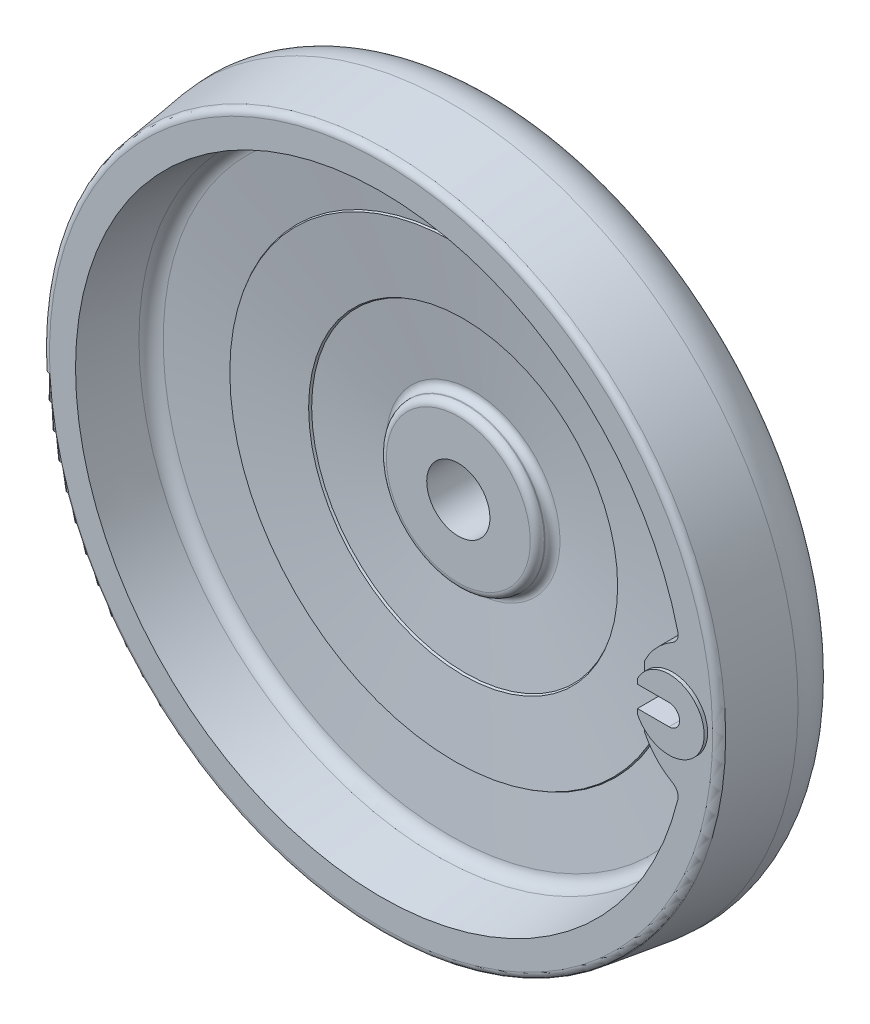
ISO-10303-21;
HEADER;
FILE_DESCRIPTION(('STEP AP214'),'2;1');
FILE_NAME('part.step','',(''),(''),'','','');
FILE_SCHEMA(('AUTOMOTIVE_DESIGN { 1 0 10303 214 1 1 1 1 }'));
ENDSEC;
DATA;
#1=APPLICATION_CONTEXT('core data for automotive mechanical design processes');
#2=APPLICATION_PROTOCOL_DEFINITION('international standard','automotive_design',2000,#1);
#3=PRODUCT_CONTEXT('',#1,'mechanical');
#4=PRODUCT('Part','Part','',(#3));
#5=PRODUCT_RELATED_PRODUCT_CATEGORY('part','',(#4));
#6=PRODUCT_DEFINITION_FORMATION('','',#4);
#7=PRODUCT_DEFINITION_CONTEXT('part definition',#1,'design');
#8=PRODUCT_DEFINITION('design','',#6,#7);
#9=PRODUCT_DEFINITION_SHAPE('','',#8);
#10=(LENGTH_UNIT() NAMED_UNIT(*) SI_UNIT(.MILLI.,.METRE.));
#11=(NAMED_UNIT(*) PLANE_ANGLE_UNIT() SI_UNIT($,.RADIAN.));
#12=(NAMED_UNIT(*) SI_UNIT($,.STERADIAN.) SOLID_ANGLE_UNIT());
#13=UNCERTAINTY_MEASURE_WITH_UNIT(LENGTH_MEASURE(1.E-05),#10,'distance_accuracy_value','');
#14=(GEOMETRIC_REPRESENTATION_CONTEXT(3) GLOBAL_UNCERTAINTY_ASSIGNED_CONTEXT((#13)) GLOBAL_UNIT_ASSIGNED_CONTEXT((#10,
#11,#12)) REPRESENTATION_CONTEXT('',''));
#15=CARTESIAN_POINT('',(0.,0.,0.));
#16=DIRECTION('',(0.,0.,1.));
#17=DIRECTION('',(1.,0.,0.));
#18=AXIS2_PLACEMENT_3D('',#15,#16,#17);
#19=CARTESIAN_POINT('',(74.,4.3588989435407,32.4999999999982));
#20=DIRECTION('',(-1.,0.,0.));
#21=DIRECTION('',(0.,1.,0.));
#22=AXIS2_PLACEMENT_3D('',#19,#20,#21);
#23=PLANE('',#22);
#24=DIRECTION('',(0.,-1.,0.));
#25=VECTOR('',#24,1.);
#26=CARTESIAN_POINT('',(74.,2.99999999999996,40.4999999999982));
#27=LINE('',#26,#25);
#28=CARTESIAN_POINT('',(74.,2.99999999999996,40.4999999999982));
#29=VERTEX_POINT('',#28);
#30=CARTESIAN_POINT('',(74.,-2.99999999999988,40.4999999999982));
#31=VERTEX_POINT('',#30);
#32=EDGE_CURVE('E426',#29,#31,#27,.T.);
#33=ORIENTED_EDGE('',*,*,#32,.F.);
#34=DIRECTION('',(0.,0.,1.));
#35=VECTOR('',#34,1.);
#36=CARTESIAN_POINT('',(74.,2.99999999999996,40.4999999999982));
#37=LINE('',#36,#35);
#38=CARTESIAN_POINT('',(74.,2.99999999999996,54.9999999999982));
#39=VERTEX_POINT('',#38);
#40=EDGE_CURVE('E153',#29,#39,#37,.T.);
#41=ORIENTED_EDGE('',*,*,#40,.T.);
#42=DIRECTION('',(0.,-1.,0.));
#43=VECTOR('',#42,1.);
#44=CARTESIAN_POINT('',(74.,4.3588989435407,54.9999999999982));
#45=LINE('',#44,#43);
#46=CARTESIAN_POINT('',(74.,4.3588989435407,54.9999999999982));
#47=VERTEX_POINT('',#46);
#48=EDGE_CURVE('E160',#47,#39,#45,.T.);
#49=ORIENTED_EDGE('',*,*,#48,.F.);
#50=DIRECTION('',(0.,0.,1.));
#51=VECTOR('',#50,1.);
#52=CARTESIAN_POINT('',(74.,4.3588989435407,32.4999999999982));
#53=LINE('',#52,#51);
#54=CARTESIAN_POINT('',(74.,4.3588989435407,33.796130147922));
#55=VERTEX_POINT('',#54);
#56=EDGE_CURVE('E163',#55,#47,#53,.T.);
#57=ORIENTED_EDGE('',*,*,#56,.F.);
#58=CARTESIAN_POINT('',(74.,-7.45844997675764,33.8262095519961));
#59=CARTESIAN_POINT('',(74.,-5.67068262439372,33.8043038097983));
#60=CARTESIAN_POINT('',(74.,-3.88281812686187,33.7902627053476));
#61=CARTESIAN_POINT('',(74.,-0.307172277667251,33.7779444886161));
#62=CARTESIAN_POINT('',(74.,1.48060906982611,33.7796661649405));
#63=CARTESIAN_POINT('',(74.,5.05608358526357,33.798904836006));
#64=CARTESIAN_POINT('',(74.,6.84377675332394,33.8164218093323));
#65=CARTESIAN_POINT('',(74.,10.4190826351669,33.8669168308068));
#66=CARTESIAN_POINT('',(74.,12.2066953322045,33.8998960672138));
#67=CARTESIAN_POINT('',(74.,13.9941330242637,33.94043794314));
#68=B_SPLINE_CURVE_WITH_KNOTS('',3,(#58,#59,#60,#61,#62,#63,#64,#65,#66,#67),.UNSPECIFIED.,.F.,
.F.,(4,2,2,2,4),(0.,5.36368874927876,10.7269652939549,16.0902345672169,21.4539160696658),.UNSPECIFIED.);
#69=CARTESIAN_POINT('',(74.,-4.35889894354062,33.796130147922));
#70=VERTEX_POINT('',#69);
#71=EDGE_CURVE('E22',#70,#55,#68,.T.);
#72=ORIENTED_EDGE('',*,*,#71,.F.);
#73=DIRECTION('',(0.,0.,1.));
#74=VECTOR('',#73,1.);
#75=CARTESIAN_POINT('',(74.,-4.35889894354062,32.4999999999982));
#76=LINE('',#75,#74);
#77=CARTESIAN_POINT('',(74.,-4.35889894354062,54.9999999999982));
#78=VERTEX_POINT('',#77);
#79=EDGE_CURVE('E165',#70,#78,#76,.T.);
#80=ORIENTED_EDGE('',*,*,#79,.T.);
#81=CARTESIAN_POINT('',(74.,-2.99999999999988,54.9999999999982));
#82=VERTEX_POINT('',#81);
#83=EDGE_CURVE('E159',#82,#78,#45,.T.);
#84=ORIENTED_EDGE('',*,*,#83,.F.);
#85=DIRECTION('',(0.,0.,1.));
#86=VECTOR('',#85,1.);
#87=CARTESIAN_POINT('',(74.,-2.99999999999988,40.4999999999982));
#88=LINE('',#87,#86);
#89=EDGE_CURVE('E144',#31,#82,#88,.T.);
#90=ORIENTED_EDGE('',*,*,#89,.F.);
#91=EDGE_LOOP('',(#33,#41,#49,#57,#72,#80,#84,#90));
#92=FACE_BOUND('',#91,.T.);
#93=ADVANCED_FACE('F14',(#92),#23,.T.);
#94=CARTESIAN_POINT('',(83.,0.,54.9999999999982));
#95=DIRECTION('',(0.,0.,1.));
#96=DIRECTION('',(0.,-1.,0.));
#97=AXIS2_PLACEMENT_3D('',#94,#95,#96);
#98=PLANE('',#97);
#99=ORIENTED_EDGE('',*,*,#48,.T.);
#100=DIRECTION('',(1.,0.,0.));
#101=VECTOR('',#100,1.);
#102=CARTESIAN_POINT('',(74.,2.99999999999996,54.9999999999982));
#103=LINE('',#102,#101);
#104=CARTESIAN_POINT('',(83.,3.,54.9999999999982));
#105=VERTEX_POINT('',#104);
#106=EDGE_CURVE('E431',#39,#105,#103,.T.);
#107=ORIENTED_EDGE('',*,*,#106,.T.);
#108=CARTESIAN_POINT('',(83.,0.,54.9999999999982));
#109=DIRECTION('',(0.,0.,-1.));
#110=DIRECTION('',(0.,1.,0.));
#111=AXIS2_PLACEMENT_3D('',#108,#109,#110);
#112=CIRCLE('',#111,2.99999999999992);
#113=CARTESIAN_POINT('',(83.,-2.99999999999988,54.9999999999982));
#114=VERTEX_POINT('',#113);
#115=EDGE_CURVE('E444',#105,#114,#112,.T.);
#116=ORIENTED_EDGE('',*,*,#115,.T.);
#117=DIRECTION('',(1.,0.,0.));
#118=VECTOR('',#117,1.);
#119=CARTESIAN_POINT('',(74.,-2.99999999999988,54.9999999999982));
#120=LINE('',#119,#118);
#121=EDGE_CURVE('E142',#82,#114,#120,.T.);
#122=ORIENTED_EDGE('',*,*,#121,.F.);
#123=ORIENTED_EDGE('',*,*,#83,.T.);
#124=CARTESIAN_POINT('',(83.,0.,54.9999999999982));
#125=DIRECTION('',(0.,0.,1.));
#126=DIRECTION('',(0.,-1.,0.));
#127=AXIS2_PLACEMENT_3D('',#124,#125,#126);
#128=CIRCLE('',#127,10.);
#129=EDGE_CURVE('E156',#78,#47,#128,.T.);
#130=ORIENTED_EDGE('',*,*,#129,.T.);
#131=EDGE_LOOP('',(#99,#107,#116,#122,#123,#130));
#132=FACE_BOUND('',#131,.T.);
#133=ADVANCED_FACE('F198',(#132),#98,.T.);
#134=CARTESIAN_POINT('',(75.,8.71779788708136,31.999999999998));
#135=DIRECTION('',(-1.,0.,0.));
#136=DIRECTION('',(0.,1.,0.));
#137=AXIS2_PLACEMENT_3D('',#134,#135,#136);
#138=PLANE('',#137);
#139=DIRECTION('',(0.,0.,1.));
#140=VECTOR('',#139,1.);
#141=CARTESIAN_POINT('',(75.,-6.,32.4999999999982));
#142=LINE('',#141,#140);
#143=CARTESIAN_POINT('',(75.,-6.,33.9316606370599));
#144=VERTEX_POINT('',#143);
#145=CARTESIAN_POINT('',(75.,-6.,53.9999999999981));
#146=VERTEX_POINT('',#145);
#147=EDGE_CURVE('E213',#144,#146,#142,.T.);
#148=ORIENTED_EDGE('',*,*,#147,.F.);
#149=CARTESIAN_POINT('',(75.,-11.9885308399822,34.0185514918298));
#150=CARTESIAN_POINT('',(75.,-10.4449398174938,33.9888161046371));
#151=CARTESIAN_POINT('',(75.,-8.9012387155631,33.9647180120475));
#152=CARTESIAN_POINT('',(75.,-5.81369877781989,33.9279693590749));
#153=CARTESIAN_POINT('',(75.,-4.26985994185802,33.9153188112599));
#154=CARTESIAN_POINT('',(75.,-1.18246247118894,33.9016397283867));
#155=CARTESIAN_POINT('',(75.,0.361096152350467,33.9006086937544));
#156=CARTESIAN_POINT('',(75.,3.44817562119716,33.9101670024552));
#157=CARTESIAN_POINT('',(75.,4.99169646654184,33.9207563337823));
#158=CARTESIAN_POINT('',(75.,8.07859542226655,33.9534345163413));
#159=CARTESIAN_POINT('',(75.,9.62197353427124,33.9755232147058));
#160=CARTESIAN_POINT('',(75.,12.7085300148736,34.0309478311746));
#161=CARTESIAN_POINT('',(75.,14.2517083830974,34.0642837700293));
#162=CARTESIAN_POINT('',(75.,17.3381236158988,34.1418509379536));
#163=CARTESIAN_POINT('',(75.,18.8813604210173,34.1860845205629));
#164=CARTESIAN_POINT('',(75.,21.967492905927,34.284967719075));
#165=CARTESIAN_POINT('',(75.,23.510388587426,34.3396172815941));
#166=CARTESIAN_POINT('',(75.,25.0530886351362,34.3992372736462));
#167=B_SPLINE_CURVE_WITH_KNOTS('',3,(#149,#150,#151,#152,#153,#154,#155,#156,#157,#158,#159,
#160,#161,#162,#163,#164,#165,#166),.UNSPECIFIED.,.F.,.F.,(4,2,2,2,2,2,2,2,4),(0.,
4.63162414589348,9.26325337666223,13.8938862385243,18.5245143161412,23.1550808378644,
27.7856559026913,32.4172319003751,37.0487841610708),.UNSPECIFIED.);
#168=CARTESIAN_POINT('',(75.,-8.71779788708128,33.9640203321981));
#169=VERTEX_POINT('',#168);
#170=EDGE_CURVE('E219',#169,#144,#167,.T.);
#171=ORIENTED_EDGE('',*,*,#170,.F.);
#172=DIRECTION('',(0.,0.,1.));
#173=VECTOR('',#172,1.);
#174=CARTESIAN_POINT('',(75.,-8.71779788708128,31.999999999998));
#175=LINE('',#174,#173);
#176=CARTESIAN_POINT('',(75.,-8.71779788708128,53.9999999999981));
#177=VERTEX_POINT('',#176);
#178=EDGE_CURVE('E382',#169,#177,#175,.T.);
#179=ORIENTED_EDGE('',*,*,#178,.T.);
#180=DIRECTION('',(0.,-1.,0.));
#181=VECTOR('',#180,1.);
#182=CARTESIAN_POINT('',(75.,8.71779788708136,53.9999999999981));
#183=LINE('',#182,#181);
#184=EDGE_CURVE('E403',#146,#177,#183,.T.);
#185=ORIENTED_EDGE('',*,*,#184,.F.);
#186=EDGE_LOOP('',(#148,#171,#179,#185));
#187=FACE_BOUND('',#186,.T.);
#188=ADVANCED_FACE('F242',(#187),#138,.T.);
#189=CARTESIAN_POINT('',(0.,0.,51.9999999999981));
#190=DIRECTION('',(0.,0.,1.));
#191=DIRECTION('',(0.,-1.,0.));
#192=AXIS2_PLACEMENT_3D('',#189,#190,#191);
#193=TOROIDAL_SURFACE('',#192,94.4272112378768,2.);
#194=CARTESIAN_POINT('',(0.,0.,52.2702264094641));
#195=DIRECTION('',(0.,0.,1.));
#196=DIRECTION('',(0.,-1.,0.));
#197=AXIS2_PLACEMENT_3D('',#194,#195,#196);
#198=CIRCLE('',#197,96.4088715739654);
#199=CARTESIAN_POINT('',(0.,-96.4088715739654,52.2702264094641));
#200=VERTEX_POINT('',#199);
#201=EDGE_CURVE('E278',#200,#200,#198,.T.);
#202=ORIENTED_EDGE('',*,*,#201,.T.);
#203=EDGE_LOOP('',(#202));
#204=FACE_BOUND('',#203,.T.);
#205=CARTESIAN_POINT('',(0.,0.,53.9999999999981));
#206=DIRECTION('',(0.,0.,1.));
#207=DIRECTION('',(0.,-1.,0.));
#208=AXIS2_PLACEMENT_3D('',#205,#206,#207);
#209=CIRCLE('',#208,94.4272112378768);
#210=CARTESIAN_POINT('',(0.,-94.4272112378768,53.9999999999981));
#211=VERTEX_POINT('',#210);
#212=EDGE_CURVE('E349',#211,#211,#209,.T.);
#213=ORIENTED_EDGE('',*,*,#212,.F.);
#214=EDGE_LOOP('',(#213));
#215=FACE_BOUND('',#214,.T.);
#216=ADVANCED_FACE('F16',(#204,#215),#193,.T.);
#217=CARTESIAN_POINT('',(0.,0.,34.1428085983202));
#218=DIRECTION('',(0.,0.,-1.));
#219=DIRECTION('',(0.,1.,0.));
#220=AXIS2_PLACEMENT_3D('',#217,#218,#219);
#221=CONICAL_SURFACE('',#220,98.8807921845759,0.135527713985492);
#222=ORIENTED_EDGE('',*,*,#201,.F.);
#223=EDGE_LOOP('',(#222));
#224=FACE_BOUND('',#223,.T.);
#225=CARTESIAN_POINT('',(0.,0.,34.1428085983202));
#226=DIRECTION('',(0.,0.,1.));
#227=DIRECTION('',(0.,-1.,0.));
#228=AXIS2_PLACEMENT_3D('',#225,#226,#227);
#229=CIRCLE('',#228,98.8807921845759);
#230=CARTESIAN_POINT('',(0.,-98.8807921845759,34.1428085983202));
#231=VERTEX_POINT('',#230);
#232=EDGE_CURVE('E281',#231,#231,#229,.T.);
#233=ORIENTED_EDGE('',*,*,#232,.T.);
#234=EDGE_LOOP('',(#233));
#235=FACE_BOUND('',#234,.T.);
#236=ADVANCED_FACE('F715',(#224,#235),#221,.T.);
#237=CARTESIAN_POINT('',(0.,0.,32.3863369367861));
#238=DIRECTION('',(0.,0.,1.));
#239=DIRECTION('',(0.,-1.,0.));
#240=AXIS2_PLACEMENT_3D('',#237,#238,#239);
#241=TOROIDAL_SURFACE('',#240,86.,12.9999999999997);
#242=CARTESIAN_POINT('',(0.,0.,23.657029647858));
#243=DIRECTION('',(0.,0.,1.));
#244=DIRECTION('',(0.,-1.,0.));
#245=AXIS2_PLACEMENT_3D('',#242,#243,#244);
#246=CIRCLE('',#245,95.6332338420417);
#247=CARTESIAN_POINT('',(0.,-95.6332338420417,23.657029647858));
#248=VERTEX_POINT('',#247);
#249=EDGE_CURVE('E284',#248,#248,#246,.T.);
#250=ORIENTED_EDGE('',*,*,#249,.T.);
#251=EDGE_LOOP('',(#250));
#252=FACE_BOUND('',#251,.T.);
#253=ORIENTED_EDGE('',*,*,#232,.F.);
#254=EDGE_LOOP('',(#253));
#255=FACE_BOUND('',#254,.T.);
#256=ADVANCED_FACE('F706',(#252,#255),#241,.T.);
#257=CARTESIAN_POINT('',(0.,0.,25.));
#258=DIRECTION('',(0.,0.,1.));
#259=DIRECTION('',(0.,-1.,0.));
#260=AXIS2_PLACEMENT_3D('',#257,#258,#259);
#261=TOROIDAL_SURFACE('',#260,94.151197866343,2.);
#262=CARTESIAN_POINT('',(0.,0.,23.));
#263=DIRECTION('',(0.,0.,1.));
#264=DIRECTION('',(0.,-1.,0.));
#265=AXIS2_PLACEMENT_3D('',#262,#263,#264);
#266=CIRCLE('',#265,94.151197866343);
#267=CARTESIAN_POINT('',(0.,-94.151197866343,23.));
#268=VERTEX_POINT('',#267);
#269=EDGE_CURVE('E287',#268,#268,#266,.T.);
#270=ORIENTED_EDGE('',*,*,#269,.T.);
#271=EDGE_LOOP('',(#270));
#272=FACE_BOUND('',#271,.T.);
#273=ORIENTED_EDGE('',*,*,#249,.F.);
#274=EDGE_LOOP('',(#273));
#275=FACE_BOUND('',#274,.T.);
#276=ADVANCED_FACE('F697',(#272,#275),#261,.T.);
#277=CARTESIAN_POINT('',(-40.5824934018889,0.,23.));
#278=DIRECTION('',(0.,0.,1.));
#279=DIRECTION('',(0.,-1.,0.));
#280=AXIS2_PLACEMENT_3D('',#277,#278,#279);
#281=PLANE('',#280);
#282=ORIENTED_EDGE('',*,*,#269,.F.);
#283=EDGE_LOOP('',(#282));
#284=FACE_BOUND('',#283,.T.);
#285=CARTESIAN_POINT('',(0.,0.,23.));
#286=DIRECTION('',(0.,0.,1.));
#287=DIRECTION('',(0.,-1.,0.));
#288=AXIS2_PLACEMENT_3D('',#285,#286,#287);
#289=CIRCLE('',#288,40.5824934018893);
#290=CARTESIAN_POINT('',(0.,-40.5824934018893,23.));
#291=VERTEX_POINT('',#290);
#292=EDGE_CURVE('E290',#291,#291,#289,.T.);
#293=ORIENTED_EDGE('',*,*,#292,.T.);
#294=EDGE_LOOP('',(#293));
#295=FACE_BOUND('',#294,.T.);
#296=ADVANCED_FACE('F688',(#284,#295),#281,.F.);
#297=CARTESIAN_POINT('',(0.,0.,23.));
#298=DIRECTION('',(0.,0.,1.));
#299=DIRECTION('',(0.,-1.,0.));
#300=AXIS2_PLACEMENT_3D('',#297,#298,#299);
#301=CONICAL_SURFACE('',#300,40.5824934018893,1.43345504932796);
#302=CARTESIAN_POINT('',(0.,0.,21.59910671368));
#303=DIRECTION('',(0.,0.,1.));
#304=DIRECTION('',(0.,-1.,0.));
#305=AXIS2_PLACEMENT_3D('',#302,#303,#304);
#306=CIRCLE('',#305,30.4466184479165);
#307=CARTESIAN_POINT('',(0.,-30.4466184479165,21.59910671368));
#308=VERTEX_POINT('',#307);
#309=EDGE_CURVE('E293',#308,#308,#306,.T.);
#310=ORIENTED_EDGE('',*,*,#309,.T.);
#311=EDGE_LOOP('',(#310));
#312=FACE_BOUND('',#311,.T.);
#313=ORIENTED_EDGE('',*,*,#292,.F.);
#314=EDGE_LOOP('',(#313));
#315=FACE_BOUND('',#314,.T.);
#316=ADVANCED_FACE('F679',(#312,#315),#301,.T.);
#317=CARTESIAN_POINT('',(0.,0.,17.6367727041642));
#318=DIRECTION('',(0.,0.,1.));
#319=DIRECTION('',(0.,-1.,0.));
#320=AXIS2_PLACEMENT_3D('',#317,#318,#319);
#321=TOROIDAL_SURFACE('',#320,30.9942581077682,4.);
#322=ORIENTED_EDGE('',*,*,#309,.F.);
#323=EDGE_LOOP('',(#322));
#324=FACE_BOUND('',#323,.T.);
#325=CARTESIAN_POINT('',(0.,0.,17.6367727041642));
#326=DIRECTION('',(0.,0.,1.));
#327=DIRECTION('',(0.,-1.,0.));
#328=AXIS2_PLACEMENT_3D('',#325,#326,#327);
#329=CIRCLE('',#328,26.9942581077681);
#330=CARTESIAN_POINT('',(0.,-26.9942581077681,17.6367727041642));
#331=VERTEX_POINT('',#330);
#332=EDGE_CURVE('E296',#331,#331,#329,.T.);
#333=ORIENTED_EDGE('',*,*,#332,.T.);
#334=EDGE_LOOP('',(#333));
#335=FACE_BOUND('',#334,.T.);
#336=ADVANCED_FACE('F670',(#324,#335),#321,.F.);
#337=CARTESIAN_POINT('',(0.,0.,77.));
#338=DIRECTION('',(0.,0.,1.));
#339=DIRECTION('',(0.,-1.,0.));
#340=AXIS2_PLACEMENT_3D('',#337,#338,#339);
#341=CYLINDRICAL_SURFACE('',#340,26.9942581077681);
#342=CARTESIAN_POINT('',(0.,0.,15.));
#343=DIRECTION('',(0.,0.,1.));
#344=DIRECTION('',(0.,-1.,0.));
#345=AXIS2_PLACEMENT_3D('',#342,#343,#344);
#346=CIRCLE('',#345,26.9942581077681);
#347=CARTESIAN_POINT('',(0.,-26.9942581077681,15.));
#348=VERTEX_POINT('',#347);
#349=EDGE_CURVE('E299',#348,#348,#346,.T.);
#350=ORIENTED_EDGE('',*,*,#349,.T.);
#351=EDGE_LOOP('',(#350));
#352=FACE_BOUND('',#351,.T.);
#353=ORIENTED_EDGE('',*,*,#332,.F.);
#354=EDGE_LOOP('',(#353));
#355=FACE_BOUND('',#354,.T.);
#356=ADVANCED_FACE('F661',(#352,#355),#341,.T.);
#357=CARTESIAN_POINT('',(-26.9942581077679,0.,15.));
#358=DIRECTION('',(0.,0.,-1.));
#359=DIRECTION('',(0.,1.,0.));
#360=AXIS2_PLACEMENT_3D('',#357,#358,#359);
#361=PLANE('',#360);
#362=CARTESIAN_POINT('',(0.,0.,15.0000000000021));
#363=DIRECTION('',(0.,0.,1.));
#364=DIRECTION('',(0.,-1.,0.));
#365=AXIS2_PLACEMENT_3D('',#362,#363,#364);
#366=CIRCLE('',#365,22.5);
#367=CARTESIAN_POINT('',(0.,-22.5,15.0000000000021));
#368=VERTEX_POINT('',#367);
#369=EDGE_CURVE('E302',#368,#368,#366,.T.);
#370=ORIENTED_EDGE('',*,*,#369,.T.);
#371=EDGE_LOOP('',(#370));
#372=FACE_BOUND('',#371,.T.);
#373=ORIENTED_EDGE('',*,*,#349,.F.);
#374=EDGE_LOOP('',(#373));
#375=FACE_BOUND('',#374,.T.);
#376=ADVANCED_FACE('F652',(#372,#375),#361,.T.);
#377=CARTESIAN_POINT('',(0.,0.,77.));
#378=DIRECTION('',(0.,0.,1.));
#379=DIRECTION('',(0.,-1.,0.));
#380=AXIS2_PLACEMENT_3D('',#377,#378,#379);
#381=CYLINDRICAL_SURFACE('',#380,22.5);
#382=CARTESIAN_POINT('',(0.,0.,2.000000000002));
#383=DIRECTION('',(0.,0.,1.));
#384=DIRECTION('',(0.,-1.,0.));
#385=AXIS2_PLACEMENT_3D('',#382,#383,#384);
#386=CIRCLE('',#385,22.5);
#387=CARTESIAN_POINT('',(0.,-22.5,2.000000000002));
#388=VERTEX_POINT('',#387);
#389=EDGE_CURVE('E305',#388,#388,#386,.T.);
#390=ORIENTED_EDGE('',*,*,#389,.T.);
#391=EDGE_LOOP('',(#390));
#392=FACE_BOUND('',#391,.T.);
#393=ORIENTED_EDGE('',*,*,#369,.F.);
#394=EDGE_LOOP('',(#393));
#395=FACE_BOUND('',#394,.T.);
#396=ADVANCED_FACE('F643',(#392,#395),#381,.T.);
#397=CARTESIAN_POINT('',(0.,0.,2.000000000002));
#398=DIRECTION('',(0.,0.,1.));
#399=DIRECTION('',(0.,-1.,0.));
#400=AXIS2_PLACEMENT_3D('',#397,#398,#399);
#401=TOROIDAL_SURFACE('',#400,20.5,2.);
#402=CARTESIAN_POINT('',(0.,0.,1.99840144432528E-12));
#403=DIRECTION('',(0.,0.,1.));
#404=DIRECTION('',(0.,-1.,0.));
#405=AXIS2_PLACEMENT_3D('',#402,#403,#404);
#406=CIRCLE('',#405,20.5);
#407=CARTESIAN_POINT('',(0.,-20.5,1.99840144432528E-12));
#408=VERTEX_POINT('',#407);
#409=EDGE_CURVE('E308',#408,#408,#406,.T.);
#410=ORIENTED_EDGE('',*,*,#409,.T.);
#411=EDGE_LOOP('',(#410));
#412=FACE_BOUND('',#411,.T.);
#413=ORIENTED_EDGE('',*,*,#389,.F.);
#414=EDGE_LOOP('',(#413));
#415=FACE_BOUND('',#414,.T.);
#416=ADVANCED_FACE('F634',(#412,#415),#401,.T.);
#417=CARTESIAN_POINT('',(-9.,0.,0.));
#418=DIRECTION('',(0.,0.,1.));
#419=DIRECTION('',(0.,-1.,0.));
#420=AXIS2_PLACEMENT_3D('',#417,#418,#419);
#421=PLANE('',#420);
#422=ORIENTED_EDGE('',*,*,#409,.F.);
#423=EDGE_LOOP('',(#422));
#424=FACE_BOUND('',#423,.T.);
#425=CARTESIAN_POINT('',(0.,0.,0.));
#426=DIRECTION('',(0.,0.,1.));
#427=DIRECTION('',(0.,-1.,0.));
#428=AXIS2_PLACEMENT_3D('',#425,#426,#427);
#429=CIRCLE('',#428,9.);
#430=CARTESIAN_POINT('',(0.,-9.,0.));
#431=VERTEX_POINT('',#430);
#432=EDGE_CURVE('E311',#431,#431,#429,.T.);
#433=ORIENTED_EDGE('',*,*,#432,.T.);
#434=EDGE_LOOP('',(#433));
#435=FACE_BOUND('',#434,.T.);
#436=ADVANCED_FACE('F625',(#424,#435),#421,.F.);
#437=CARTESIAN_POINT('',(0.,0.,77.));
#438=DIRECTION('',(0.,0.,1.));
#439=DIRECTION('',(0.,-1.,0.));
#440=AXIS2_PLACEMENT_3D('',#437,#438,#439);
#441=CYLINDRICAL_SURFACE('',#440,9.);
#442=ORIENTED_EDGE('',*,*,#432,.F.);
#443=EDGE_LOOP('',(#442));
#444=FACE_BOUND('',#443,.T.);
#445=CARTESIAN_POINT('',(0.,0.,32.000000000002));
#446=DIRECTION('',(0.,0.,1.));
#447=DIRECTION('',(0.,-1.,0.));
#448=AXIS2_PLACEMENT_3D('',#445,#446,#447);
#449=CIRCLE('',#448,9.);
#450=CARTESIAN_POINT('',(0.,-9.,32.000000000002));
#451=VERTEX_POINT('',#450);
#452=EDGE_CURVE('E314',#451,#451,#449,.T.);
#453=ORIENTED_EDGE('',*,*,#452,.T.);
#454=EDGE_LOOP('',(#453));
#455=FACE_BOUND('',#454,.T.);
#456=ADVANCED_FACE('F616',(#444,#455),#441,.F.);
#457=CARTESIAN_POINT('',(-9.,0.,32.000000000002));
#458=DIRECTION('',(0.,0.,1.));
#459=DIRECTION('',(0.,-1.,0.));
#460=AXIS2_PLACEMENT_3D('',#457,#458,#459);
#461=PLANE('',#460);
#462=CARTESIAN_POINT('',(0.,0.,32.000000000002));
#463=DIRECTION('',(0.,0.,1.));
#464=DIRECTION('',(0.,-1.,0.));
#465=AXIS2_PLACEMENT_3D('',#462,#463,#464);
#466=CIRCLE('',#465,20.5);
#467=CARTESIAN_POINT('',(0.,-20.5,32.000000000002));
#468=VERTEX_POINT('',#467);
#469=EDGE_CURVE('E317',#468,#468,#466,.T.);
#470=ORIENTED_EDGE('',*,*,#469,.T.);
#471=EDGE_LOOP('',(#470));
#472=FACE_BOUND('',#471,.T.);
#473=ORIENTED_EDGE('',*,*,#452,.F.);
#474=EDGE_LOOP('',(#473));
#475=FACE_BOUND('',#474,.T.);
#476=ADVANCED_FACE('F607',(#472,#475),#461,.T.);
#477=CARTESIAN_POINT('',(0.,0.,30.000000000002));
#478=DIRECTION('',(0.,0.,1.));
#479=DIRECTION('',(0.,-1.,0.));
#480=AXIS2_PLACEMENT_3D('',#477,#478,#479);
#481=TOROIDAL_SURFACE('',#480,20.5,2.);
#482=CARTESIAN_POINT('',(0.,0.,30.000000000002));
#483=DIRECTION('',(0.,0.,1.));
#484=DIRECTION('',(0.,-1.,0.));
#485=AXIS2_PLACEMENT_3D('',#482,#483,#484);
#486=CIRCLE('',#485,22.5);
#487=CARTESIAN_POINT('',(0.,-22.5,30.000000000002));
#488=VERTEX_POINT('',#487);
#489=EDGE_CURVE('E320',#488,#488,#486,.T.);
#490=ORIENTED_EDGE('',*,*,#489,.T.);
#491=EDGE_LOOP('',(#490));
#492=FACE_BOUND('',#491,.T.);
#493=ORIENTED_EDGE('',*,*,#469,.F.);
#494=EDGE_LOOP('',(#493));
#495=FACE_BOUND('',#494,.T.);
#496=ADVANCED_FACE('F598',(#492,#495),#481,.T.);
#497=CARTESIAN_POINT('',(0.,0.,77.));
#498=DIRECTION('',(0.,0.,1.));
#499=DIRECTION('',(0.,-1.,0.));
#500=AXIS2_PLACEMENT_3D('',#497,#498,#499);
#501=CYLINDRICAL_SURFACE('',#500,22.5000001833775);
#502=CARTESIAN_POINT('',(0.,0.,29.7594114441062));
#503=DIRECTION('',(0.,0.,1.));
#504=DIRECTION('',(0.,-1.,0.));
#505=AXIS2_PLACEMENT_3D('',#502,#503,#504);
#506=CIRCLE('',#505,22.5000003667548);
#507=CARTESIAN_POINT('',(0.,-22.5000003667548,29.7594114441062));
#508=VERTEX_POINT('',#507);
#509=EDGE_CURVE('E323',#508,#508,#506,.T.);
#510=ORIENTED_EDGE('',*,*,#509,.T.);
#511=EDGE_LOOP('',(#510));
#512=FACE_BOUND('',#511,.T.);
#513=ORIENTED_EDGE('',*,*,#489,.F.);
#514=EDGE_LOOP('',(#513));
#515=FACE_BOUND('',#514,.T.);
#516=ADVANCED_FACE('F589',(#512,#515),#501,.T.);
#517=CARTESIAN_POINT('',(0.,0.,29.7594114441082));
#518=DIRECTION('',(0.,0.,1.));
#519=DIRECTION('',(0.,-1.,0.));
#520=AXIS2_PLACEMENT_3D('',#517,#518,#519);
#521=TOROIDAL_SURFACE('',#520,24.4999998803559,1.99999951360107);
#522=ORIENTED_EDGE('',*,*,#509,.F.);
#523=EDGE_LOOP('',(#522));
#524=FACE_BOUND('',#523,.T.);
#525=CARTESIAN_POINT('',(0.,0.,27.7741208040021));
#526=DIRECTION('',(0.,0.,1.));
#527=DIRECTION('',(0.,-1.,0.));
#528=AXIS2_PLACEMENT_3D('',#525,#526,#527);
#529=CIRCLE('',#528,24.7421097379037);
#530=CARTESIAN_POINT('',(0.,-24.7421097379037,27.7741208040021));
#531=VERTEX_POINT('',#530);
#532=EDGE_CURVE('E326',#531,#531,#529,.T.);
#533=ORIENTED_EDGE('',*,*,#532,.T.);
#534=EDGE_LOOP('',(#533));
#535=FACE_BOUND('',#534,.T.);
#536=ADVANCED_FACE('F580',(#524,#535),#521,.F.);
#537=CARTESIAN_POINT('',(0.,0.,30.0837999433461));
#538=DIRECTION('',(0.,0.,1.));
#539=DIRECTION('',(0.,-1.,0.));
#540=AXIS2_PLACEMENT_3D('',#537,#538,#539);
#541=CONICAL_SURFACE('',#540,43.6814176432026,1.44944393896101);
#542=ORIENTED_EDGE('',*,*,#532,.F.);
#543=EDGE_LOOP('',(#542));
#544=FACE_BOUND('',#543,.T.);
#545=CARTESIAN_POINT('',(0.,0.,30.0837999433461));
#546=DIRECTION('',(0.,0.,1.));
#547=DIRECTION('',(0.,-1.,0.));
#548=AXIS2_PLACEMENT_3D('',#545,#546,#547);
#549=CIRCLE('',#548,43.6814176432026);
#550=CARTESIAN_POINT('',(0.,-43.6814176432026,30.0837999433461));
#551=VERTEX_POINT('',#550);
#552=EDGE_CURVE('E329',#551,#551,#549,.T.);
#553=ORIENTED_EDGE('',*,*,#552,.T.);
#554=EDGE_LOOP('',(#553));
#555=FACE_BOUND('',#554,.T.);
#556=ADVANCED_FACE('F571',(#544,#555),#541,.F.);
#557=CARTESIAN_POINT('',(0.,0.,30.6256555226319));
#558=DIRECTION('',(0.,0.,1.));
#559=DIRECTION('',(0.,-1.,0.));
#560=AXIS2_PLACEMENT_3D('',#557,#558,#559);
#561=CONICAL_SURFACE('',#560,44.,0.531509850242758);
#562=ORIENTED_EDGE('',*,*,#552,.F.);
#563=EDGE_LOOP('',(#562));
#564=FACE_BOUND('',#563,.T.);
#565=CARTESIAN_POINT('',(0.,0.,30.6256555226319));
#566=DIRECTION('',(0.,0.,1.));
#567=DIRECTION('',(0.,-1.,0.));
#568=AXIS2_PLACEMENT_3D('',#565,#566,#567);
#569=CIRCLE('',#568,44.);
#570=CARTESIAN_POINT('',(0.,-44.,30.6256555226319));
#571=VERTEX_POINT('',#570);
#572=EDGE_CURVE('E332',#571,#571,#569,.T.);
#573=ORIENTED_EDGE('',*,*,#572,.T.);
#574=EDGE_LOOP('',(#573));
#575=FACE_BOUND('',#574,.T.);
#576=ADVANCED_FACE('F562',(#564,#575),#561,.F.);
#577=CARTESIAN_POINT('',(0.,0.,33.064679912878));
#578=DIRECTION('',(0.,0.,1.));
#579=DIRECTION('',(0.,-1.,0.));
#580=AXIS2_PLACEMENT_3D('',#577,#578,#579);
#581=CONICAL_SURFACE('',#580,64.,1.44944432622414);
#582=ORIENTED_EDGE('',*,*,#572,.F.);
#583=EDGE_LOOP('',(#582));
#584=FACE_BOUND('',#583,.T.);
#585=CARTESIAN_POINT('',(0.,0.,33.064679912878));
#586=DIRECTION('',(0.,0.,1.));
#587=DIRECTION('',(0.,-1.,0.));
#588=AXIS2_PLACEMENT_3D('',#585,#586,#587);
#589=CIRCLE('',#588,64.);
#590=CARTESIAN_POINT('',(0.,-64.,33.064679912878));
#591=VERTEX_POINT('',#590);
#592=EDGE_CURVE('E335',#591,#591,#589,.T.);
#593=ORIENTED_EDGE('',*,*,#592,.T.);
#594=EDGE_LOOP('',(#593));
#595=FACE_BOUND('',#594,.T.);
#596=ADVANCED_FACE('F554',(#584,#595),#581,.F.);
#597=CARTESIAN_POINT('',(0.,0.,33.064679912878));
#598=DIRECTION('',(0.,0.,-1.));
#599=DIRECTION('',(0.,1.,0.));
#600=AXIS2_PLACEMENT_3D('',#597,#598,#599);
#601=CONICAL_SURFACE('',#600,64.,0.52359877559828);
#602=CARTESIAN_POINT('',(0.,0.,32.594107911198));
#603=DIRECTION('',(0.,0.,1.));
#604=DIRECTION('',(0.,-1.,0.));
#605=AXIS2_PLACEMENT_3D('',#602,#603,#604);
#606=CIRCLE('',#605,64.2716848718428);
#607=CARTESIAN_POINT('',(0.,-64.2716848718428,32.594107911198));
#608=VERTEX_POINT('',#607);
#609=EDGE_CURVE('E338',#608,#608,#606,.T.);
#610=ORIENTED_EDGE('',*,*,#609,.T.);
#611=EDGE_LOOP('',(#610));
#612=FACE_BOUND('',#611,.T.);
#613=ORIENTED_EDGE('',*,*,#592,.F.);
#614=EDGE_LOOP('',(#613));
#615=FACE_BOUND('',#614,.T.);
#616=ADVANCED_FACE('F547',(#612,#615),#601,.T.);
#617=CARTESIAN_POINT('',(0.,0.,34.6772836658));
#618=DIRECTION('',(0.,0.,1.));
#619=DIRECTION('',(0.,-1.,0.));
#620=AXIS2_PLACEMENT_3D('',#617,#618,#619);
#621=CONICAL_SURFACE('',#620,81.3537260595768,1.44944432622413);
#622=ORIENTED_EDGE('',*,*,#170,.T.);
#623=CARTESIAN_POINT('',(79.9326126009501,-9.51793751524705,34.5728402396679));
#624=CARTESIAN_POINT('',(79.6644079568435,-9.43153235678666,34.539117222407));
#625=CARTESIAN_POINT('',(79.3998439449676,-9.33372789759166,34.505674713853));
#626=CARTESIAN_POINT('',(78.8798184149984,-9.11610643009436,34.4396100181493));
#627=CARTESIAN_POINT('',(78.6243570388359,-8.99628907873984,34.4069878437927));
#628=CARTESIAN_POINT('',(78.1241510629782,-8.73531823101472,34.3427965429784));
#629=CARTESIAN_POINT('',(77.8794158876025,-8.59414643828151,34.3112283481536));
#630=CARTESIAN_POINT('',(77.4026569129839,-8.29152904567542,34.2494381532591));
#631=CARTESIAN_POINT('',(77.1706324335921,-8.13008453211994,34.2192160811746));
#632=CARTESIAN_POINT('',(76.7207538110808,-7.78787617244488,34.160350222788));
#633=CARTESIAN_POINT('',(76.5029123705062,-7.60709538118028,34.1317078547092));
#634=CARTESIAN_POINT('',(76.0832095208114,-7.22758945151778,34.076286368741));
#635=CARTESIAN_POINT('',(75.8813479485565,-7.02886449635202,34.0495072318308));
#636=CARTESIAN_POINT('',(75.4954288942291,-6.61523110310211,33.998105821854));
#637=CARTESIAN_POINT('',(75.3113405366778,-6.40035192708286,33.9734798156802));
#638=CARTESIAN_POINT('',(74.9619906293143,-5.95569466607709,33.9265758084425));
#639=CARTESIAN_POINT('',(74.7967205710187,-5.7259233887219,33.9042967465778));
#640=CARTESIAN_POINT('',(74.522375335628,-5.30819555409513,33.8671936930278));
#641=CARTESIAN_POINT('',(74.4091808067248,-5.12297557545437,33.8518424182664));
#642=CARTESIAN_POINT('',(74.1951566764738,-4.74570850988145,33.8227505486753));
#643=CARTESIAN_POINT('',(74.0943118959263,-4.55367018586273,33.8090079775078));
#644=CARTESIAN_POINT('',(73.9998,-4.3584859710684,33.796102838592));
#645=B_SPLINE_CURVE_WITH_KNOTS('',3,(#623,#624,#625,#626,#627,#628,#629,#630,#631,#632,#633,
#634,#635,#636,#637,#638,#639,#640,#641,#642,#643,#644),.UNSPECIFIED.,.F.,.F.,(4,2,2,2,2,2,2,2,
2,2,4),(0.,0.851116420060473,1.70224610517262,2.55410920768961,3.40592668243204,
4.25849685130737,5.11105831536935,5.96211101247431,6.81277737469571,7.46516868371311,
8.11674990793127),.UNSPECIFIED.);
#646=EDGE_CURVE('E180',#144,#70,#645,.T.);
#647=ORIENTED_EDGE('',*,*,#646,.T.);
#648=ORIENTED_EDGE('',*,*,#71,.T.);
#649=CARTESIAN_POINT('',(73.9998,4.35848597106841,33.796102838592));
#650=CARTESIAN_POINT('',(74.1224885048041,4.61190621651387,33.8128552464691));
#651=CARTESIAN_POINT('',(74.255892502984,4.86003311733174,33.8310249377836));
#652=CARTESIAN_POINT('',(74.5430144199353,5.34400515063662,33.8699961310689));
#653=CARTESIAN_POINT('',(74.6967310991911,5.57985103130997,33.8907974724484));
#654=CARTESIAN_POINT('',(75.0233928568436,6.03762012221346,33.9348335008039));
#655=CARTESIAN_POINT('',(75.1963398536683,6.25954193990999,33.9580684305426));
#656=CARTESIAN_POINT('',(75.560167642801,6.68788777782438,34.0067447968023));
#657=CARTESIAN_POINT('',(75.7510478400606,6.89431231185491,34.0321861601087));
#658=CARTESIAN_POINT('',(76.1494571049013,7.29033569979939,34.0850524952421));
#659=CARTESIAN_POINT('',(76.3569940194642,7.4799265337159,34.1124784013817));
#660=CARTESIAN_POINT('',(76.7871445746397,7.84087068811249,34.1690569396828));
#661=CARTESIAN_POINT('',(77.0097582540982,8.01222396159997,34.1982095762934));
#662=CARTESIAN_POINT('',(77.4681406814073,8.33528921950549,34.2579456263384));
#663=CARTESIAN_POINT('',(77.7038902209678,8.4870288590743,34.2885269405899));
#664=CARTESIAN_POINT('',(78.1870817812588,8.77007266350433,34.35089287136));
#665=CARTESIAN_POINT('',(78.4345188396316,8.90138540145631,34.3826769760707));
#666=CARTESIAN_POINT('',(78.8889148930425,9.11861252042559,34.4407480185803));
#667=CARTESIAN_POINT('',(79.0940767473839,9.20835463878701,34.4668636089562));
#668=CARTESIAN_POINT('',(79.509602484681,9.37374532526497,34.519540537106));
#669=CARTESIAN_POINT('',(79.7199584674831,9.44941396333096,34.5461011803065));
#670=CARTESIAN_POINT('',(79.9326126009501,9.51793751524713,34.5728402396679));
#671=B_SPLINE_CURVE_WITH_KNOTS('',3,(#649,#650,#651,#652,#653,#654,#655,#656,#657,#658,#659,
#660,#661,#662,#663,#664,#665,#666,#667,#668,#669,#670),.UNSPECIFIED.,.F.,.F.,(4,2,2,2,2,2,2,2,
2,2,4),(0.,0.845895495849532,1.69173939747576,2.53766775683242,3.38356805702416,
4.22986922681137,5.07617257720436,5.92126931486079,6.76601040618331,7.44187159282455,
8.11676142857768),.UNSPECIFIED.);
#672=CARTESIAN_POINT('',(75.,6.,33.9316606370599));
#673=VERTEX_POINT('',#672);
#674=EDGE_CURVE('E171',#55,#673,#671,.T.);
#675=ORIENTED_EDGE('',*,*,#674,.T.);
#676=CARTESIAN_POINT('',(75.,8.71779788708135,33.9640203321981));
#677=VERTEX_POINT('',#676);
#678=EDGE_CURVE('E227',#673,#677,#167,.T.);
#679=ORIENTED_EDGE('',*,*,#678,.T.);
#680=CARTESIAN_POINT('',(74.999903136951,8.71759788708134,33.9640057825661));
#681=CARTESIAN_POINT('',(75.1235581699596,8.97291960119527,33.9825796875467));
#682=CARTESIAN_POINT('',(75.252607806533,9.22553224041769,34.0019079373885));
#683=CARTESIAN_POINT('',(75.5212792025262,9.72495491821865,34.0420123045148));
#684=CARTESIAN_POINT('',(75.6609009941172,9.97176493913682,34.0627884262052));
#685=CARTESIAN_POINT('',(76.0953852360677,10.7030592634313,34.1272101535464));
#686=CARTESIAN_POINT('',(76.4057916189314,11.1782531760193,34.1729378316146));
#687=CARTESIAN_POINT('',(77.0599672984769,12.0923987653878,34.2685310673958));
#688=CARTESIAN_POINT('',(77.4030884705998,12.5318252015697,34.3183142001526));
#689=CARTESIAN_POINT('',(78.1243559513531,13.3800129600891,34.4220768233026));
#690=CARTESIAN_POINT('',(78.5024782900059,13.7887949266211,34.4760534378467));
#691=CARTESIAN_POINT('',(79.0635963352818,14.3468502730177,34.5554426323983));
#692=CARTESIAN_POINT('',(79.2333603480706,14.509824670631,34.5793758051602));
#693=CARTESIAN_POINT('',(79.5791090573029,14.8302193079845,34.6279369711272));
#694=CARTESIAN_POINT('',(79.7551140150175,14.9876173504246,34.6525671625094));
#695=CARTESIAN_POINT('',(79.9338472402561,15.1418510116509,34.6774836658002));
#696=B_SPLINE_CURVE_WITH_KNOTS('',3,(#680,#681,#682,#683,#684,#685,#686,#687,#688,#689,#690,
#691,#692,#693,#694,#695),.UNSPECIFIED.,.F.,.F.,(4,2,2,2,2,2,2,4),(0.,0.85275155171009,
1.70550569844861,3.41152895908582,5.08889030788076,6.76511132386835,7.4746264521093,
8.18670534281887),.UNSPECIFIED.);
#697=CARTESIAN_POINT('',(79.9324126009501,15.1406129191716,34.6772836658));
#698=VERTEX_POINT('',#697);
#699=EDGE_CURVE('E364',#677,#698,#696,.T.);
#700=ORIENTED_EDGE('',*,*,#699,.T.);
#701=CARTESIAN_POINT('',(0.,0.,34.6772836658));
#702=DIRECTION('',(0.,0.,1.));
#703=DIRECTION('',(0.,-1.,0.));
#704=AXIS2_PLACEMENT_3D('',#701,#702,#703);
#705=CIRCLE('',#704,81.3537260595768);
#706=CARTESIAN_POINT('',(79.9324126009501,-15.1406129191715,34.6772836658));
#707=VERTEX_POINT('',#706);
#708=EDGE_CURVE('E341',#698,#707,#705,.T.);
#709=ORIENTED_EDGE('',*,*,#708,.T.);
#710=CARTESIAN_POINT('',(79.9338472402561,-15.1418510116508,34.6774836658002));
#711=CARTESIAN_POINT('',(79.7198059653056,-14.9571503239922,34.6476451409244));
#712=CARTESIAN_POINT('',(79.5096752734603,-14.7679066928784,34.6182167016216));
#713=CARTESIAN_POINT('',(79.0975571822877,-14.3806144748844,34.5602490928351));
#714=CARTESIAN_POINT('',(78.8955699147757,-14.1825657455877,34.5317099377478));
#715=CARTESIAN_POINT('',(78.3021540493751,-13.5754761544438,34.4475084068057));
#716=CARTESIAN_POINT('',(77.9234479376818,-13.153644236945,34.3932866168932));
#717=CARTESIAN_POINT('',(77.2091138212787,-12.286507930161,34.2902115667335));
#718=CARTESIAN_POINT('',(76.8728656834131,-11.8417210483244,34.2412830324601));
#719=CARTESIAN_POINT('',(76.2386394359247,-10.9255120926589,34.148346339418));
#720=CARTESIAN_POINT('',(75.9406340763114,-10.4541093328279,34.1043346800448));
#721=CARTESIAN_POINT('',(75.5452031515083,-9.7665645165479,34.0455697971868));
#722=CARTESIAN_POINT('',(75.4312125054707,-9.55998967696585,34.0285804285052));
#723=CARTESIAN_POINT('',(75.210178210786,-9.14211582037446,33.9955516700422));
#724=CARTESIAN_POINT('',(75.1031613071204,-8.93080236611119,33.9795159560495));
#725=CARTESIAN_POINT('',(74.999903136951,-8.71759788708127,33.9640057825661));
#726=B_SPLINE_CURVE_WITH_KNOTS('',3,(#710,#711,#712,#713,#714,#715,#716,#717,#718,#719,#720,
#721,#722,#723,#724,#725),.UNSPECIFIED.,.F.,.F.,(4,2,2,2,2,2,2,4),(0.,0.852721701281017,
1.70545719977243,3.41162940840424,5.08895178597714,6.76507226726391,7.47459979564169,
8.18670522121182),.UNSPECIFIED.);
#727=EDGE_CURVE('E352',#707,#169,#726,.T.);
#728=ORIENTED_EDGE('',*,*,#727,.T.);
#729=EDGE_LOOP('',(#622,#647,#648,#675,#679,#700,#709,#728));
#730=FACE_BOUND('',#729,.T.);
#731=ORIENTED_EDGE('',*,*,#609,.F.);
#732=EDGE_LOOP('',(#731));
#733=FACE_BOUND('',#732,.T.);
#734=ADVANCED_FACE('F186',(#730,#733),#621,.F.);
#735=CARTESIAN_POINT('',(0.,0.,38.647867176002));
#736=DIRECTION('',(0.,0.,1.));
#737=DIRECTION('',(0.,-1.,0.));
#738=AXIS2_PLACEMENT_3D('',#735,#736,#737);
#739=TOROIDAL_SURFACE('',#738,80.8695085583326,3.9999999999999);
#740=CARTESIAN_POINT('',(0.,0.,38.1074143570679));
#741=DIRECTION('',(0.,0.,1.));
#742=DIRECTION('',(0.,-1.,0.));
#743=AXIS2_PLACEMENT_3D('',#740,#741,#742);
#744=CIRCLE('',#743,84.8328292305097);
#745=CARTESIAN_POINT('',(83.0409081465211,17.3440620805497,38.1074143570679));
#746=VERTEX_POINT('',#745);
#747=CARTESIAN_POINT('',(83.0409081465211,-17.3440620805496,38.1074143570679));
#748=VERTEX_POINT('',#747);
#749=EDGE_CURVE('E344',#746,#748,#744,.T.);
#750=ORIENTED_EDGE('',*,*,#749,.T.);
#751=CARTESIAN_POINT('',(83.0409330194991,-17.3440763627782,38.107614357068));
#752=CARTESIAN_POINT('',(83.0276104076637,-17.3364195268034,38.0003489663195));
#753=CARTESIAN_POINT('',(83.0102987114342,-17.3264653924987,37.8937471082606));
#754=CARTESIAN_POINT('',(82.9679416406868,-17.3019787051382,37.682638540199));
#755=CARTESIAN_POINT('',(82.9428971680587,-17.2874466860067,37.578131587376));
#756=CARTESIAN_POINT('',(82.8853659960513,-17.2538479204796,37.372135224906));
#757=CARTESIAN_POINT('',(82.8528923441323,-17.2347891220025,37.2706408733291));
#758=CARTESIAN_POINT('',(82.7808179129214,-17.1921515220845,37.0711952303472));
#759=CARTESIAN_POINT('',(82.7412171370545,-17.1685727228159,36.9732439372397));
#760=CARTESIAN_POINT('',(82.6552947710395,-17.1169384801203,36.7815611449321));
#761=CARTESIAN_POINT('',(82.6089731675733,-17.0888830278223,36.6878296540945));
#762=CARTESIAN_POINT('',(82.5100661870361,-17.0283484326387,36.5051798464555));
#763=CARTESIAN_POINT('',(82.4574785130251,-16.9958676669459,36.4162633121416));
#764=CARTESIAN_POINT('',(82.3466152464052,-16.9265962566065,36.2438922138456));
#765=CARTESIAN_POINT('',(82.288342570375,-16.8898078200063,36.1604348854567));
#766=CARTESIAN_POINT('',(82.1666487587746,-16.8120111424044,35.9994017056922));
#767=CARTESIAN_POINT('',(82.1032257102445,-16.7710013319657,35.9218280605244));
#768=CARTESIAN_POINT('',(81.9708360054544,-16.6842408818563,35.7718509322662));
#769=CARTESIAN_POINT('',(81.9017981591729,-16.6384261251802,35.699547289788));
#770=CARTESIAN_POINT('',(81.7597361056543,-16.5427876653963,35.5618158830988));
#771=CARTESIAN_POINT('',(81.6867104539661,-16.4929625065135,35.496390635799));
#772=CARTESIAN_POINT('',(81.4626401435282,-16.3377536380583,35.3108518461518));
#773=CARTESIAN_POINT('',(81.3065555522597,-16.2266063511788,35.2014231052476));
#774=CARTESIAN_POINT('',(80.9772006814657,-15.9842602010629,35.0068565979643));
#775=CARTESIAN_POINT('',(80.8034597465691,-15.8522653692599,34.9235320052));
#776=CARTESIAN_POINT('',(80.4530773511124,-15.5764005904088,34.7900555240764));
#777=CARTESIAN_POINT('',(80.2764394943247,-15.4325446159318,34.7398652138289));
#778=CARTESIAN_POINT('',(80.0440180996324,-15.2364096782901,34.6943715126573));
#779=CARTESIAN_POINT('',(79.9874071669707,-15.1880949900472,34.6849169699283));
#780=CARTESIAN_POINT('',(79.9309755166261,-15.1393724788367,34.6770836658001));
#781=B_SPLINE_CURVE_WITH_KNOTS('',3,(#751,#752,#753,#754,#755,#756,#757,#758,#759,#760,#761,
#762,#763,#764,#765,#766,#767,#768,#769,#770,#771,#772,#773,#774,#775,#776,#777,#778,#779,#780),
.UNSPECIFIED.,.F.,.F.,(4,2,2,2,2,2,2,2,2,2,2,2,2,2,4),(0.,0.324977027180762,0.649916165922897,
0.974288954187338,1.29866158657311,1.62303486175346,1.94752740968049,2.27185434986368,
2.59630230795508,2.92582480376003,3.25546746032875,3.91452692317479,4.61245467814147,
5.30957170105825,5.53454774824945),.UNSPECIFIED.);
#782=EDGE_CURVE('E358',#748,#707,#781,.T.);
#783=ORIENTED_EDGE('',*,*,#782,.T.);
#784=ORIENTED_EDGE('',*,*,#708,.F.);
#785=CARTESIAN_POINT('',(79.9309755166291,15.1393724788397,34.6770836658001));
#786=CARTESIAN_POINT('',(80.0275748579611,15.2227765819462,34.6904952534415));
#787=CARTESIAN_POINT('',(80.1246347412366,15.3049349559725,34.7086372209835));
#788=CARTESIAN_POINT('',(80.318976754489,15.4663342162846,34.75465103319));
#789=CARTESIAN_POINT('',(80.4162589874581,15.545573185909,34.7825291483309));
#790=CARTESIAN_POINT('',(80.6106500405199,15.7009422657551,34.8484133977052));
#791=CARTESIAN_POINT('',(80.7077561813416,15.7770570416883,34.8864638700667));
#792=CARTESIAN_POINT('',(80.9004371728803,15.9253051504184,34.9727713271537));
#793=CARTESIAN_POINT('',(80.9960123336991,15.997439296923,35.0210262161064));
#794=CARTESIAN_POINT('',(81.1850750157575,16.1375789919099,35.1280038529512));
#795=CARTESIAN_POINT('',(81.2785517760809,16.2055654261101,35.1867707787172));
#796=CARTESIAN_POINT('',(81.4619143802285,16.3366238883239,35.314503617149));
#797=CARTESIAN_POINT('',(81.5518004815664,16.3996962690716,35.3834687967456));
#798=CARTESIAN_POINT('',(81.7266845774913,16.5204003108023,35.5311480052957));
#799=CARTESIAN_POINT('',(81.8116929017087,16.5780436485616,35.6098402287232));
#800=CARTESIAN_POINT('',(81.9759147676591,16.6876988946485,35.7766252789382));
#801=CARTESIAN_POINT('',(82.0551290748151,16.7397115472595,35.8647168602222));
#802=CARTESIAN_POINT('',(82.1994803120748,16.8331652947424,36.0408743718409));
#803=CARTESIAN_POINT('',(82.2652396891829,16.8751412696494,36.1281478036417));
#804=CARTESIAN_POINT('',(82.3903676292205,16.9540901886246,36.3092832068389));
#805=CARTESIAN_POINT('',(82.4497367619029,16.9910635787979,36.4031445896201));
#806=CARTESIAN_POINT('',(82.5613991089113,17.0598920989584,36.5968037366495));
#807=CARTESIAN_POINT('',(82.6136909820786,17.0917462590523,36.6966026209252));
#808=CARTESIAN_POINT('',(82.7105449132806,17.1502276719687,36.9012966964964));
#809=CARTESIAN_POINT('',(82.7551085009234,17.176855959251,37.0061908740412));
#810=CARTESIAN_POINT('',(82.8553641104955,17.2363349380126,37.2716294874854));
#811=CARTESIAN_POINT('',(82.9061759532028,17.2660651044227,37.4347832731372));
#812=CARTESIAN_POINT('',(82.9677850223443,17.3018846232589,37.6841259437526));
#813=CARTESIAN_POINT('',(82.9858836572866,17.3123601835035,37.7679853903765));
#814=CARTESIAN_POINT('',(83.0171389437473,17.330400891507,37.9369509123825));
#815=CARTESIAN_POINT('',(83.0302943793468,17.3379653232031,38.0220572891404));
#816=CARTESIAN_POINT('',(83.0409330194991,17.3440763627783,38.107614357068));
#817=B_SPLINE_CURVE_WITH_KNOTS('',3,(#785,#786,#787,#788,#789,#790,#791,#792,#793,#794,#795,
#796,#797,#798,#799,#800,#801,#802,#803,#804,#805,#806,#807,#808,#809,#810,#811,#812,#813,#814,
#815,#816),.UNSPECIFIED.,.F.,.F.,(4,2,2,2,2,2,2,2,2,2,2,2,2,2,2,4),(0.,0.384931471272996,
0.770111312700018,1.15699820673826,1.54380571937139,1.93227874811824,2.32072386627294,
2.70831346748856,3.09585177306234,3.44657605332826,3.7972690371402,4.14802838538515,
4.49871823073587,5.01723270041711,5.27634897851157,5.53552895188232),.UNSPECIFIED.);
#818=EDGE_CURVE('E369',#698,#746,#817,.T.);
#819=ORIENTED_EDGE('',*,*,#818,.T.);
#820=EDGE_LOOP('',(#750,#783,#784,#819));
#821=FACE_BOUND('',#820,.T.);
#822=ADVANCED_FACE('F251',(#821),#739,.F.);
#823=CARTESIAN_POINT('',(0.,0.,38.1074143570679));
#824=DIRECTION('',(0.,0.,1.));
#825=DIRECTION('',(0.,-1.,0.));
#826=AXIS2_PLACEMENT_3D('',#823,#824,#825);
#827=CONICAL_SURFACE('',#826,84.8328292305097,0.135527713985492);
#828=CARTESIAN_POINT('',(83.079676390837,17.3662655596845,38.4190074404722));
#829=CARTESIAN_POINT('',(83.0732091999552,17.3625712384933,38.3670415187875));
#830=CARTESIAN_POINT('',(83.0667428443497,17.3588725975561,38.3150758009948));
#831=CARTESIAN_POINT('',(83.0538118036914,17.35146667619,38.2111447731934));
#832=CARTESIAN_POINT('',(83.0473471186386,17.3477593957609,38.1591794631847));
#833=CARTESIAN_POINT('',(83.0408832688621,17.344047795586,38.107214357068));
#834=B_SPLINE_CURVE_WITH_KNOTS('',3,(#828,#829,#830,#831,#832,#833),.UNSPECIFIED.,.F.,.F.,(4,2,
4),(0.,0.157490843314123,0.314981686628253),.UNSPECIFIED.);
#835=CARTESIAN_POINT('',(83.079476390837,17.3661513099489,38.417400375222));
#836=VERTEX_POINT('',#835);
#837=EDGE_CURVE('E228',#836,#746,#834,.T.);
#838=ORIENTED_EDGE('',*,*,#837,.F.);
#839=CARTESIAN_POINT('',(83.0792763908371,17.3660370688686,38.415793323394));
#840=CARTESIAN_POINT('',(83.1408735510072,17.4012478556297,38.9107883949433));
#841=CARTESIAN_POINT('',(83.2019208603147,17.438986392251,39.4056781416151));
#842=CARTESIAN_POINT('',(83.3227833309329,17.5200252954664,40.3951895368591));
#843=CARTESIAN_POINT('',(83.3825983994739,17.5633260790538,40.889811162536));
#844=CARTESIAN_POINT('',(83.5008813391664,17.6560115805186,41.8788776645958));
#845=CARTESIAN_POINT('',(83.5593485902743,17.7053990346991,42.3733223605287));
#846=CARTESIAN_POINT('',(83.6747017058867,17.8109907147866,43.3616529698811));
#847=CARTESIAN_POINT('',(83.7315876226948,17.8671947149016,43.8555389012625));
#848=CARTESIAN_POINT('',(83.8490952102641,17.9934509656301,44.8919046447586));
#849=CARTESIAN_POINT('',(83.9095220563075,18.0643258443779,45.4343079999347));
#850=CARTESIAN_POINT('',(83.9980412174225,18.1793170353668,46.2468869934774));
#851=CARTESIAN_POINT('',(84.0271928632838,18.2190919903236,46.5175638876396));
#852=CARTESIAN_POINT('',(84.0846835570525,18.3019212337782,47.0585007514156));
#853=CARTESIAN_POINT('',(84.1130226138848,18.3449754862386,47.3287607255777));
#854=CARTESIAN_POINT('',(84.1786460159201,18.4507817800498,47.9645735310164));
#855=CARTESIAN_POINT('',(84.2155359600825,18.5151020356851,48.3299083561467));
#856=CARTESIAN_POINT('',(84.287112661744,18.6523090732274,49.0592094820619));
#857=CARTESIAN_POINT('',(84.3217994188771,18.7251958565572,49.4231757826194));
#858=CARTESIAN_POINT('',(84.3775325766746,18.8571653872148,50.0326582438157));
#859=CARTESIAN_POINT('',(84.3993884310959,18.913188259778,50.278761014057));
#860=CARTESIAN_POINT('',(84.4412990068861,19.0318966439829,50.7695038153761));
#861=CARTESIAN_POINT('',(84.4613539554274,19.0945813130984,51.0141440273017));
#862=CARTESIAN_POINT('',(84.4930130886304,19.2076069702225,51.4239047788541));
#863=CARTESIAN_POINT('',(84.5052798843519,19.2555554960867,51.5896320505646));
#864=CARTESIAN_POINT('',(84.5283031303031,19.3568226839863,51.9196059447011));
#865=CARTESIAN_POINT('',(84.5390593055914,19.4101423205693,52.0838522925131));
#866=CARTESIAN_POINT('',(84.5554371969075,19.5062728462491,52.3590712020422));
#867=CARTESIAN_POINT('',(84.5616137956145,19.5471718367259,52.4706761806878));
#868=CARTESIAN_POINT('',(84.5726486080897,19.6333699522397,52.6921644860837));
#869=CARTESIAN_POINT('',(84.5775079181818,19.6786653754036,52.80204917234));
#870=CARTESIAN_POINT('',(84.5841889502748,19.7605271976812,52.9861168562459));
#871=CARTESIAN_POINT('',(84.5864850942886,19.7955436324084,53.0609689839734));
#872=CARTESIAN_POINT('',(84.5899039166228,19.8694054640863,53.2090203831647));
#873=CARTESIAN_POINT('',(84.5910241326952,19.9082587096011,53.2822158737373));
#874=CARTESIAN_POINT('',(84.5916386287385,19.993834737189,53.4306497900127));
#875=CARTESIAN_POINT('',(84.5910161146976,20.0409145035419,53.5056839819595));
#876=CARTESIAN_POINT('',(84.5868933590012,20.1433294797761,53.6498291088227));
#877=CARTESIAN_POINT('',(84.5834050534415,20.1986296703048,53.7189633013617));
#878=CARTESIAN_POINT('',(84.5750252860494,20.2850237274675,53.806796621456));
#879=CARTESIAN_POINT('',(84.5722276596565,20.3107623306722,53.8308908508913));
#880=CARTESIAN_POINT('',(84.5655839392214,20.3647243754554,53.876048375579));
#881=CARTESIAN_POINT('',(84.5617377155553,20.392948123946,53.8971112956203));
#882=CARTESIAN_POINT('',(84.5534427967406,20.4474388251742,53.9317969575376));
#883=CARTESIAN_POINT('',(84.5491842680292,20.4733143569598,53.9460689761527));
#884=CARTESIAN_POINT('',(84.5395978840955,20.5268147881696,53.9702026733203));
#885=CARTESIAN_POINT('',(84.534274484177,20.5544320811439,53.9800821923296));
#886=CARTESIAN_POINT('',(84.5249302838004,20.5993078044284,53.9913614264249));
#887=CARTESIAN_POINT('',(84.5212655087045,20.6161900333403,53.9945764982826));
#888=CARTESIAN_POINT('',(84.5135646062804,20.6502288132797,53.9989144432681));
#889=CARTESIAN_POINT('',(84.5095266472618,20.6673863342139,54.0000263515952));
#890=CARTESIAN_POINT('',(84.50532738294,20.6845266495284,53.9999999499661));
#891=B_SPLINE_CURVE_WITH_KNOTS('',3,(#839,#840,#841,#842,#843,#844,#845,#846,#847,#848,#849,
#850,#851,#852,#853,#854,#855,#856,#857,#858,#859,#860,#861,#862,#863,#864,#865,#866,#867,#868,
#869,#870,#871,#872,#873,#874,#875,#876,#877,#878,#879,#880,#881,#882,#883,#884,#885,#886,#887,
#888,#889,#890),.UNSPECIFIED.,.F.,.F.,(4,2,2,2,2,2,2,2,2,2,2,2,2,2,2,2,2,2,2,2,2,2,2,2,2,4),(0.,
1.5001643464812,3.00044122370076,4.50139503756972,6.00229914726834,7.65320346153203,
8.47858374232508,9.30395495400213,10.4222257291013,11.5404966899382,12.3004596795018,
13.0603266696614,13.5791414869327,14.0980506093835,14.4550536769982,14.8117587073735,
15.0596930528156,15.3081455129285,15.5736394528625,15.8380331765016,15.9439727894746,
16.0499255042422,16.1391984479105,16.2281054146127,16.2806994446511,16.3335669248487),.UNSPECIFIED.);
#892=CARTESIAN_POINT('',(84.5053763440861,20.6843266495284,53.9999999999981));
#893=VERTEX_POINT('',#892);
#894=EDGE_CURVE('E265',#836,#893,#891,.T.);
#895=ORIENTED_EDGE('',*,*,#894,.T.);
#896=CARTESIAN_POINT('',(0.,0.,53.9999999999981));
#897=DIRECTION('',(0.,0.,1.));
#898=DIRECTION('',(0.,-1.,0.));
#899=AXIS2_PLACEMENT_3D('',#896,#897,#898);
#900=CIRCLE('',#899,87.);
#901=CARTESIAN_POINT('',(84.5053763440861,-20.6843266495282,53.9999999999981));
#902=VERTEX_POINT('',#901);
#903=EDGE_CURVE('E347',#893,#902,#900,.T.);
#904=ORIENTED_EDGE('',*,*,#903,.T.);
#905=CARTESIAN_POINT('',(83.0792763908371,-17.3660370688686,38.415793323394));
#906=CARTESIAN_POINT('',(83.1408735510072,-17.4012478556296,38.9107883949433));
#907=CARTESIAN_POINT('',(83.2019208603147,-17.4389863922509,39.4056781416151));
#908=CARTESIAN_POINT('',(83.3227833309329,-17.5200252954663,40.3951895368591));
#909=CARTESIAN_POINT('',(83.3825983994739,-17.5633260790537,40.889811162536));
#910=CARTESIAN_POINT('',(83.5008813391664,-17.6560115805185,41.8788776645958));
#911=CARTESIAN_POINT('',(83.5593485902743,-17.705399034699,42.3733223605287));
#912=CARTESIAN_POINT('',(83.6747017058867,-17.8109907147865,43.3616529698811));
#913=CARTESIAN_POINT('',(83.7315876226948,-17.8671947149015,43.8555389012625));
#914=CARTESIAN_POINT('',(83.8490952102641,-17.99345096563,44.8919046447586));
#915=CARTESIAN_POINT('',(83.9095220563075,-18.0643258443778,45.4343079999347));
#916=CARTESIAN_POINT('',(83.9980412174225,-18.1793170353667,46.2468869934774));
#917=CARTESIAN_POINT('',(84.0271928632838,-18.2190919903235,46.5175638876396));
#918=CARTESIAN_POINT('',(84.0846835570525,-18.3019212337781,47.0585007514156));
#919=CARTESIAN_POINT('',(84.1130226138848,-18.3449754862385,47.3287607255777));
#920=CARTESIAN_POINT('',(84.1786460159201,-18.4507817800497,47.9645735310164));
#921=CARTESIAN_POINT('',(84.2155359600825,-18.515102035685,48.3299083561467));
#922=CARTESIAN_POINT('',(84.287112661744,-18.6523090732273,49.0592094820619));
#923=CARTESIAN_POINT('',(84.3217994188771,-18.7251958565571,49.4231757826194));
#924=CARTESIAN_POINT('',(84.3775325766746,-18.8571653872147,50.0326582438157));
#925=CARTESIAN_POINT('',(84.3993884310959,-18.9131882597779,50.278761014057));
#926=CARTESIAN_POINT('',(84.4412990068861,-19.0318966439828,50.7695038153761));
#927=CARTESIAN_POINT('',(84.4613539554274,-19.0945813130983,51.0141440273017));
#928=CARTESIAN_POINT('',(84.4930130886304,-19.2076069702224,51.423904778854));
#929=CARTESIAN_POINT('',(84.5052798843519,-19.2555554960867,51.5896320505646));
#930=CARTESIAN_POINT('',(84.5283031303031,-19.3568226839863,51.9196059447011));
#931=CARTESIAN_POINT('',(84.5390593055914,-19.4101423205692,52.0838522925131));
#932=CARTESIAN_POINT('',(84.5554371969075,-19.506272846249,52.3590712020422));
#933=CARTESIAN_POINT('',(84.5616137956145,-19.5471718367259,52.4706761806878));
#934=CARTESIAN_POINT('',(84.5726486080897,-19.6333699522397,52.6921644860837));
#935=CARTESIAN_POINT('',(84.5775079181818,-19.6786653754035,52.8020491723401));
#936=CARTESIAN_POINT('',(84.5841889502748,-19.7605271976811,52.9861168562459));
#937=CARTESIAN_POINT('',(84.5864850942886,-19.7955436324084,53.0609689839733));
#938=CARTESIAN_POINT('',(84.5899039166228,-19.8694054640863,53.2090203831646));
#939=CARTESIAN_POINT('',(84.5910241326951,-19.908258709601,53.2822158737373));
#940=CARTESIAN_POINT('',(84.5916386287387,-19.9938347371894,53.4306497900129));
#941=CARTESIAN_POINT('',(84.591016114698,-20.0409145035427,53.5056839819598));
#942=CARTESIAN_POINT('',(84.5868933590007,-20.1433294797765,53.6498291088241));
#943=CARTESIAN_POINT('',(84.5834050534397,-20.1986296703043,53.7189633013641));
#944=CARTESIAN_POINT('',(84.5750252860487,-20.285023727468,53.8067966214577));
#945=CARTESIAN_POINT('',(84.5722276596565,-20.310762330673,53.8308908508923));
#946=CARTESIAN_POINT('',(84.5655839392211,-20.3647243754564,53.8760483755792));
#947=CARTESIAN_POINT('',(84.5617377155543,-20.3929481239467,53.8971112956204));
#948=CARTESIAN_POINT('',(84.5534427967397,-20.4474388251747,53.9317969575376));
#949=CARTESIAN_POINT('',(84.5491842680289,-20.4733143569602,53.9460689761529));
#950=CARTESIAN_POINT('',(84.5395978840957,-20.52681478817,53.9702026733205));
#951=CARTESIAN_POINT('',(84.5342744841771,-20.5544320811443,53.9800821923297));
#952=CARTESIAN_POINT('',(84.5249302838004,-20.5993078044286,53.9913614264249));
#953=CARTESIAN_POINT('',(84.5212655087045,-20.6161900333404,53.9945764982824));
#954=CARTESIAN_POINT('',(84.5135646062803,-20.6502288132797,53.9989144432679));
#955=CARTESIAN_POINT('',(84.5095266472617,-20.6673863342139,54.000026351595));
#956=CARTESIAN_POINT('',(84.50532738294,-20.6845266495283,53.9999999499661));
#957=B_SPLINE_CURVE_WITH_KNOTS('',3,(#905,#906,#907,#908,#909,#910,#911,#912,#913,#914,#915,
#916,#917,#918,#919,#920,#921,#922,#923,#924,#925,#926,#927,#928,#929,#930,#931,#932,#933,#934,
#935,#936,#937,#938,#939,#940,#941,#942,#943,#944,#945,#946,#947,#948,#949,#950,#951,#952,#953,
#954,#955,#956),.UNSPECIFIED.,.F.,.F.,(4,2,2,2,2,2,2,2,2,2,2,2,2,2,2,2,2,2,2,2,2,2,2,2,2,4),(0.,
1.50016434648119,3.00044122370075,4.50139503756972,6.00229914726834,7.65320346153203,
8.47858374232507,9.30395495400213,10.4222257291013,11.5404966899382,12.3004596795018,
13.0603266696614,13.5791414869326,14.0980506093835,14.4550536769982,14.8117587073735,
15.0596930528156,15.3081455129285,15.5736394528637,15.8380331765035,15.9439727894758,
16.0499255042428,16.139198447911,16.228105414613,16.2806994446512,16.3335669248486),.UNSPECIFIED.);
#958=CARTESIAN_POINT('',(83.079476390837,-17.3661513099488,38.417400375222));
#959=VERTEX_POINT('',#958);
#960=EDGE_CURVE('E257',#959,#902,#957,.T.);
#961=ORIENTED_EDGE('',*,*,#960,.F.);
#962=CARTESIAN_POINT('',(83.0408832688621,-17.3440477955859,38.107214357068));
#963=CARTESIAN_POINT('',(83.0473471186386,-17.3477593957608,38.1591794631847));
#964=CARTESIAN_POINT('',(83.0538118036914,-17.3514666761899,38.2111447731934));
#965=CARTESIAN_POINT('',(83.0667428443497,-17.358872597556,38.3150758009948));
#966=CARTESIAN_POINT('',(83.0732091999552,-17.3625712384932,38.3670415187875));
#967=CARTESIAN_POINT('',(83.079676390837,-17.3662655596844,38.4190074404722));
#968=B_SPLINE_CURVE_WITH_KNOTS('',3,(#962,#963,#964,#965,#966,#967),.UNSPECIFIED.,.F.,.F.,(4,2,
4),(0.,0.157490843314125,0.314981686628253),.UNSPECIFIED.);
#969=EDGE_CURVE('E271',#748,#959,#968,.T.);
#970=ORIENTED_EDGE('',*,*,#969,.F.);
#971=ORIENTED_EDGE('',*,*,#749,.F.);
#972=EDGE_LOOP('',(#838,#895,#904,#961,#970,#971));
#973=FACE_BOUND('',#972,.T.);
#974=ADVANCED_FACE('F247',(#973),#827,.F.);
#975=CARTESIAN_POINT('',(-87.,0.,53.9999999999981));
#976=DIRECTION('',(0.,0.,1.));
#977=DIRECTION('',(0.,-1.,0.));
#978=AXIS2_PLACEMENT_3D('',#975,#976,#977);
#979=PLANE('',#978);
#980=CARTESIAN_POINT('',(83.,0.,53.9999999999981));
#981=DIRECTION('',(0.,0.,1.));
#982=DIRECTION('',(0.,-1.,0.));
#983=AXIS2_PLACEMENT_3D('',#980,#981,#982);
#984=CIRCLE('',#983,10.);
#985=CARTESIAN_POINT('',(75.,6.,53.9999999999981));
#986=VERTEX_POINT('',#985);
#987=EDGE_CURVE('E168',#146,#986,#984,.T.);
#988=ORIENTED_EDGE('',*,*,#987,.F.);
#989=ORIENTED_EDGE('',*,*,#184,.T.);
#990=CARTESIAN_POINT('',(93.,0.,53.9999999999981));
#991=DIRECTION('',(0.,0.,1.));
#992=DIRECTION('',(0.,-1.,0.));
#993=AXIS2_PLACEMENT_3D('',#990,#991,#992);
#994=CIRCLE('',#993,20.);
#995=CARTESIAN_POINT('',(83.079476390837,-17.3661513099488,53.9999999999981));
#996=VERTEX_POINT('',#995);
#997=EDGE_CURVE('E410',#177,#996,#994,.T.);
#998=ORIENTED_EDGE('',*,*,#997,.T.);
#999=CARTESIAN_POINT('',(81.5913978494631,-19.971074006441,53.9999999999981));
#1000=DIRECTION('',(0.,0.,-1.));
#1001=DIRECTION('',(0.,1.,0.));
#1002=AXIS2_PLACEMENT_3D('',#999,#1000,#1001);
#1003=CIRCLE('',#1002,3.);
#1004=EDGE_CURVE('E409',#996,#902,#1003,.T.);
#1005=ORIENTED_EDGE('',*,*,#1004,.T.);
#1006=ORIENTED_EDGE('',*,*,#903,.F.);
#1007=CARTESIAN_POINT('',(81.5913978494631,19.9710740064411,53.9999999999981));
#1008=DIRECTION('',(0.,0.,1.));
#1009=DIRECTION('',(0.,-1.,0.));
#1010=AXIS2_PLACEMENT_3D('',#1007,#1008,#1009);
#1011=CIRCLE('',#1010,3.);
#1012=CARTESIAN_POINT('',(83.079476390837,17.3661513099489,53.9999999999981));
#1013=VERTEX_POINT('',#1012);
#1014=EDGE_CURVE('E407',#1013,#893,#1011,.T.);
#1015=ORIENTED_EDGE('',*,*,#1014,.F.);
#1016=CARTESIAN_POINT('',(93.,0.,53.9999999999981));
#1017=DIRECTION('',(0.,0.,1.));
#1018=DIRECTION('',(0.,-1.,0.));
#1019=AXIS2_PLACEMENT_3D('',#1016,#1017,#1018);
#1020=CIRCLE('',#1019,20.);
#1021=CARTESIAN_POINT('',(75.,8.71779788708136,53.9999999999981));
#1022=VERTEX_POINT('',#1021);
#1023=EDGE_CURVE('E404',#1013,#1022,#1020,.T.);
#1024=ORIENTED_EDGE('',*,*,#1023,.T.);
#1025=EDGE_CURVE('E400',#1022,#986,#183,.T.);
#1026=ORIENTED_EDGE('',*,*,#1025,.T.);
#1027=EDGE_LOOP('',(#988,#989,#998,#1005,#1006,#1015,#1024,#1026));
#1028=FACE_BOUND('',#1027,.T.);
#1029=ORIENTED_EDGE('',*,*,#212,.T.);
#1030=EDGE_LOOP('',(#1029));
#1031=FACE_BOUND('',#1030,.T.);
#1032=ADVANCED_FACE('F240',(#1028,#1031),#979,.T.);
#1033=DIRECTION('',(0.,0.,1.));
#1034=VECTOR('',#1033,1.);
#1035=CARTESIAN_POINT('',(75.,6.,32.4999999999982));
#1036=LINE('',#1035,#1034);
#1037=EDGE_CURVE('E216',#986,#673,#1036,.F.);
#1038=ORIENTED_EDGE('',*,*,#1037,.F.);
#1039=ORIENTED_EDGE('',*,*,#1025,.F.);
#1040=DIRECTION('',(0.,0.,1.));
#1041=VECTOR('',#1040,1.);
#1042=CARTESIAN_POINT('',(75.,8.71779788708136,31.999999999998));
#1043=LINE('',#1042,#1041);
#1044=EDGE_CURVE('E388',#677,#1022,#1043,.T.);
#1045=ORIENTED_EDGE('',*,*,#1044,.F.);
#1046=ORIENTED_EDGE('',*,*,#678,.F.);
#1047=EDGE_LOOP('',(#1038,#1039,#1045,#1046));
#1048=FACE_BOUND('',#1047,.T.);
#1049=ADVANCED_FACE('F236',(#1048),#138,.T.);
#1050=CARTESIAN_POINT('',(93.,0.,31.999999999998));
#1051=DIRECTION('',(0.,0.,1.));
#1052=DIRECTION('',(0.,-1.,0.));
#1053=AXIS2_PLACEMENT_3D('',#1050,#1051,#1052);
#1054=CYLINDRICAL_SURFACE('',#1053,20.);
#1055=ORIENTED_EDGE('',*,*,#727,.F.);
#1056=ORIENTED_EDGE('',*,*,#782,.F.);
#1057=ORIENTED_EDGE('',*,*,#969,.T.);
#1058=DIRECTION('',(0.,0.,1.));
#1059=VECTOR('',#1058,1.);
#1060=CARTESIAN_POINT('',(83.079476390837,-17.3661513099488,31.999999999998));
#1061=LINE('',#1060,#1059);
#1062=EDGE_CURVE('E398',#959,#996,#1061,.T.);
#1063=ORIENTED_EDGE('',*,*,#1062,.T.);
#1064=ORIENTED_EDGE('',*,*,#997,.F.);
#1065=ORIENTED_EDGE('',*,*,#178,.F.);
#1066=EDGE_LOOP('',(#1055,#1056,#1057,#1063,#1064,#1065));
#1067=FACE_BOUND('',#1066,.T.);
#1068=ADVANCED_FACE('F205',(#1067),#1054,.T.);
#1069=CARTESIAN_POINT('',(93.,0.,31.999999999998));
#1070=DIRECTION('',(0.,0.,1.));
#1071=DIRECTION('',(0.,-1.,0.));
#1072=AXIS2_PLACEMENT_3D('',#1069,#1070,#1071);
#1073=CYLINDRICAL_SURFACE('',#1072,20.);
#1074=ORIENTED_EDGE('',*,*,#699,.F.);
#1075=ORIENTED_EDGE('',*,*,#1044,.T.);
#1076=ORIENTED_EDGE('',*,*,#1023,.F.);
#1077=DIRECTION('',(0.,0.,1.));
#1078=VECTOR('',#1077,1.);
#1079=CARTESIAN_POINT('',(83.079476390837,17.3661513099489,31.999999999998));
#1080=LINE('',#1079,#1078);
#1081=EDGE_CURVE('E394',#836,#1013,#1080,.T.);
#1082=ORIENTED_EDGE('',*,*,#1081,.F.);
#1083=ORIENTED_EDGE('',*,*,#837,.T.);
#1084=ORIENTED_EDGE('',*,*,#818,.F.);
#1085=EDGE_LOOP('',(#1074,#1075,#1076,#1082,#1083,#1084));
#1086=FACE_BOUND('',#1085,.T.);
#1087=ADVANCED_FACE('F243',(#1086),#1073,.T.);
#1088=CARTESIAN_POINT('',(81.5913978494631,19.9710740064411,31.999999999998));
#1089=DIRECTION('',(0.,0.,1.));
#1090=DIRECTION('',(0.,-1.,0.));
#1091=AXIS2_PLACEMENT_3D('',#1088,#1089,#1090);
#1092=CYLINDRICAL_SURFACE('',#1091,3.);
#1093=ORIENTED_EDGE('',*,*,#894,.F.);
#1094=ORIENTED_EDGE('',*,*,#1081,.T.);
#1095=ORIENTED_EDGE('',*,*,#1014,.T.);
#1096=EDGE_LOOP('',(#1093,#1094,#1095));
#1097=FACE_BOUND('',#1096,.T.);
#1098=ADVANCED_FACE('F497',(#1097),#1092,.F.);
#1099=CARTESIAN_POINT('',(81.5913978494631,-19.971074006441,31.999999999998));
#1100=DIRECTION('',(0.,0.,1.));
#1101=DIRECTION('',(0.,-1.,0.));
#1102=AXIS2_PLACEMENT_3D('',#1099,#1100,#1101);
#1103=CYLINDRICAL_SURFACE('',#1102,3.);
#1104=ORIENTED_EDGE('',*,*,#1062,.F.);
#1105=ORIENTED_EDGE('',*,*,#960,.T.);
#1106=ORIENTED_EDGE('',*,*,#1004,.F.);
#1107=EDGE_LOOP('',(#1104,#1105,#1106));
#1108=FACE_BOUND('',#1107,.T.);
#1109=ADVANCED_FACE('F196',(#1108),#1103,.F.);
#1110=CARTESIAN_POINT('',(83.,0.,32.4999999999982));
#1111=DIRECTION('',(0.,0.,1.));
#1112=DIRECTION('',(0.,-1.,0.));
#1113=AXIS2_PLACEMENT_3D('',#1110,#1111,#1112);
#1114=CYLINDRICAL_SURFACE('',#1113,10.);
#1115=ORIENTED_EDGE('',*,*,#646,.F.);
#1116=ORIENTED_EDGE('',*,*,#147,.T.);
#1117=ORIENTED_EDGE('',*,*,#987,.T.);
#1118=ORIENTED_EDGE('',*,*,#1037,.T.);
#1119=ORIENTED_EDGE('',*,*,#674,.F.);
#1120=ORIENTED_EDGE('',*,*,#56,.T.);
#1121=ORIENTED_EDGE('',*,*,#129,.F.);
#1122=ORIENTED_EDGE('',*,*,#79,.F.);
#1123=EDGE_LOOP('',(#1115,#1116,#1117,#1118,#1119,#1120,#1121,#1122));
#1124=FACE_BOUND('',#1123,.T.);
#1125=ADVANCED_FACE('F190',(#1124),#1114,.T.);
#1126=CARTESIAN_POINT('',(74.,2.99999999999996,40.4999999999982));
#1127=DIRECTION('',(0.,-1.,0.));
#1128=DIRECTION('',(0.,0.,-1.));
#1129=AXIS2_PLACEMENT_3D('',#1126,#1127,#1128);
#1130=PLANE('',#1129);
#1131=CARTESIAN_POINT('',(83.,3.,45.999999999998));
#1132=DIRECTION('',(0.,-1.,0.));
#1133=DIRECTION('',(0.,0.,-1.));
#1134=AXIS2_PLACEMENT_3D('',#1131,#1132,#1133);
#1135=CIRCLE('',#1134,0.750000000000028);
#1136=CARTESIAN_POINT('',(83.,3.,46.7499999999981));
#1137=VERTEX_POINT('',#1136);
#1138=CARTESIAN_POINT('',(83.,3.,45.249999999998));
#1139=VERTEX_POINT('',#1138);
#1140=EDGE_CURVE('E447',#1137,#1139,#1135,.T.);
#1141=ORIENTED_EDGE('',*,*,#1140,.F.);
#1142=DIRECTION('',(0.,0.,1.));
#1143=VECTOR('',#1142,1.);
#1144=CARTESIAN_POINT('',(83.,3.,40.4999999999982));
#1145=LINE('',#1144,#1143);
#1146=EDGE_CURVE('E146',#1137,#105,#1145,.T.);
#1147=ORIENTED_EDGE('',*,*,#1146,.T.);
#1148=ORIENTED_EDGE('',*,*,#106,.F.);
#1149=ORIENTED_EDGE('',*,*,#40,.F.);
#1150=DIRECTION('',(1.,0.,0.));
#1151=VECTOR('',#1150,1.);
#1152=CARTESIAN_POINT('',(74.,2.99999999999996,40.4999999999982));
#1153=LINE('',#1152,#1151);
#1154=CARTESIAN_POINT('',(83.,3.,40.4999999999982));
#1155=VERTEX_POINT('',#1154);
#1156=EDGE_CURVE('E147',#29,#1155,#1153,.T.);
#1157=ORIENTED_EDGE('',*,*,#1156,.T.);
#1158=EDGE_CURVE('E151',#1155,#1139,#1145,.T.);
#1159=ORIENTED_EDGE('',*,*,#1158,.T.);
#1160=EDGE_LOOP('',(#1141,#1147,#1148,#1149,#1157,#1159));
#1161=FACE_BOUND('',#1160,.T.);
#1162=ADVANCED_FACE('F195',(#1161),#1130,.T.);
#1163=CARTESIAN_POINT('',(83.,0.,40.4999999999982));
#1164=DIRECTION('',(0.,0.,1.));
#1165=DIRECTION('',(0.,-1.,0.));
#1166=AXIS2_PLACEMENT_3D('',#1163,#1164,#1165);
#1167=CYLINDRICAL_SURFACE('',#1166,2.99999999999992);
#1168=CARTESIAN_POINT('',(83.,3.,45.249999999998));
#1169=CARTESIAN_POINT('',(83.0415120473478,3.00003192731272,45.249961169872));
#1170=CARTESIAN_POINT('',(83.0829997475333,2.99913939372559,45.2534438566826));
#1171=CARTESIAN_POINT('',(83.164699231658,2.99574554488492,45.2671490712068));
#1172=CARTESIAN_POINT('',(83.2049133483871,2.99324737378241,45.2773584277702));
#1173=CARTESIAN_POINT('',(83.2830080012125,2.98688078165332,45.3042154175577));
#1174=CARTESIAN_POINT('',(83.3208886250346,2.98301241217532,45.3208628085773));
#1175=CARTESIAN_POINT('',(83.39332879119,2.9743270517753,45.3600869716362));
#1176=CARTESIAN_POINT('',(83.4278875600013,2.96950984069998,45.3826651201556));
#1177=CARTESIAN_POINT('',(83.4933998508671,2.95933743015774,45.4335992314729));
#1178=CARTESIAN_POINT('',(83.5242755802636,2.95397398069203,45.4620536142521));
#1179=CARTESIAN_POINT('',(83.5808725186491,2.94336844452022,45.5237236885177));
#1180=CARTESIAN_POINT('',(83.6065927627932,2.9381263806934,45.5569402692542));
#1181=CARTESIAN_POINT('',(83.652513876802,2.92827376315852,45.6277985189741));
#1182=CARTESIAN_POINT('',(83.6726271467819,2.92367373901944,45.6654985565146));
#1183=CARTESIAN_POINT('',(83.7061991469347,2.91574729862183,45.7438763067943));
#1184=CARTESIAN_POINT('',(83.7196592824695,2.91242061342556,45.7845533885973));
#1185=CARTESIAN_POINT('',(83.7392773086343,2.90750241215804,45.8668712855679));
#1186=CARTESIAN_POINT('',(83.7455759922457,2.90587749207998,45.908476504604));
#1187=CARTESIAN_POINT('',(83.7511309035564,2.90444680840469,45.9921833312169));
#1188=CARTESIAN_POINT('',(83.7503881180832,2.90464078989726,46.034284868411));
#1189=CARTESIAN_POINT('',(83.7419932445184,2.90679603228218,46.1167080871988));
#1190=CARTESIAN_POINT('',(83.734509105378,2.90871433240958,46.1570481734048));
#1191=CARTESIAN_POINT('',(83.7131119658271,2.91403357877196,46.2358808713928));
#1192=CARTESIAN_POINT('',(83.6991985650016,2.91743461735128,46.274373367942));
#1193=CARTESIAN_POINT('',(83.6651945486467,2.92537561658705,46.348869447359));
#1194=CARTESIAN_POINT('',(83.6450428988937,2.92992674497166,46.3848439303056));
#1195=CARTESIAN_POINT('',(83.5991774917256,2.93964867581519,46.4529601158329));
#1196=CARTESIAN_POINT('',(83.573462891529,2.94481957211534,46.4851012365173));
#1197=CARTESIAN_POINT('',(83.5163351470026,2.95537879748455,46.5455983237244));
#1198=CARTESIAN_POINT('',(83.4847808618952,2.96076913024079,46.5738208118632));
#1199=CARTESIAN_POINT('',(83.4173135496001,2.97102871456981,46.6246055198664));
#1200=CARTESIAN_POINT('',(83.3813994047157,2.97589783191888,46.6471662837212));
#1201=CARTESIAN_POINT('',(83.3060359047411,2.9845914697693,46.6860376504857));
#1202=CARTESIAN_POINT('',(83.2665731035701,2.98841177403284,46.7023231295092));
#1203=CARTESIAN_POINT('',(83.1853763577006,2.9945424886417,46.7279711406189));
#1204=CARTESIAN_POINT('',(83.1436458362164,2.9968551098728,46.7373438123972));
#1205=CARTESIAN_POINT('',(83.0846290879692,2.99885383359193,46.7454043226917));
#1206=CARTESIAN_POINT('',(83.0677378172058,2.99928307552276,46.7471280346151));
#1207=CARTESIAN_POINT('',(83.033900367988,2.99985600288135,46.7494245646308));
#1208=CARTESIAN_POINT('',(83.0169543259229,3.00000015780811,46.7499992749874));
#1209=CARTESIAN_POINT('',(83.,3.,46.7499999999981));
#1210=B_SPLINE_CURVE_WITH_KNOTS('',3,(#1168,#1169,#1170,#1171,#1172,#1173,#1174,#1175,#1176,
#1177,#1178,#1179,#1180,#1181,#1182,#1183,#1184,#1185,#1186,#1187,#1188,#1189,#1190,#1191,#1192,
#1193,#1194,#1195,#1196,#1197,#1198,#1199,#1200,#1201,#1202,#1203,#1204,#1205,#1206,#1207,#1208,
#1209),.UNSPECIFIED.,.F.,.F.,(4,2,2,2,2,2,2,2,2,2,2,2,2,2,2,2,2,2,2,2,4),(0.,0.124343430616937,
0.248444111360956,0.372540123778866,0.496664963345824,0.623067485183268,0.749493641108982,
0.877796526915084,1.00607229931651,1.13178005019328,1.25747018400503,1.38011302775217,
1.50276351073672,1.62665408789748,1.75056344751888,1.87799307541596,2.00545544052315,
2.13342294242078,2.26120236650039,2.31212245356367,2.36295861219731),.UNSPECIFIED.);
#1211=EDGE_CURVE('E29',#1139,#1137,#1210,.T.);
#1212=ORIENTED_EDGE('',*,*,#1211,.F.);
#1213=ORIENTED_EDGE('',*,*,#1158,.F.);
#1214=CARTESIAN_POINT('',(83.,0.,40.4999999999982));
#1215=DIRECTION('',(0.,0.,-1.));
#1216=DIRECTION('',(0.,1.,0.));
#1217=AXIS2_PLACEMENT_3D('',#1214,#1215,#1216);
#1218=CIRCLE('',#1217,2.99999999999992);
#1219=CARTESIAN_POINT('',(83.,-2.99999999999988,40.4999999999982));
#1220=VERTEX_POINT('',#1219);
#1221=EDGE_CURVE('E437',#1155,#1220,#1218,.T.);
#1222=ORIENTED_EDGE('',*,*,#1221,.T.);
#1223=DIRECTION('',(0.,0.,1.));
#1224=VECTOR('',#1223,1.);
#1225=CARTESIAN_POINT('',(83.,-2.99999999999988,40.4999999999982));
#1226=LINE('',#1225,#1224);
#1227=CARTESIAN_POINT('',(83.,-2.99999999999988,45.249999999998));
#1228=VERTEX_POINT('',#1227);
#1229=EDGE_CURVE('E138',#1220,#1228,#1226,.T.);
#1230=ORIENTED_EDGE('',*,*,#1229,.T.);
#1231=CARTESIAN_POINT('',(83.,-2.99999999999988,46.7499999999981));
#1232=CARTESIAN_POINT('',(83.0415120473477,-3.00003192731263,46.7500388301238));
#1233=CARTESIAN_POINT('',(83.0829997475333,-2.9991393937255,46.7465561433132));
#1234=CARTESIAN_POINT('',(83.1646992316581,-2.99574554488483,46.7328509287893));
#1235=CARTESIAN_POINT('',(83.2049133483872,-2.99324737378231,46.7226415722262));
#1236=CARTESIAN_POINT('',(83.2830080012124,-2.98688078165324,46.6957845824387));
#1237=CARTESIAN_POINT('',(83.3208886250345,-2.98301241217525,46.6791371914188));
#1238=CARTESIAN_POINT('',(83.3933287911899,-2.97432705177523,46.6399130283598));
#1239=CARTESIAN_POINT('',(83.4278875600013,-2.96950984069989,46.6173348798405));
#1240=CARTESIAN_POINT('',(83.493399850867,-2.95933743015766,46.5664007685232));
#1241=CARTESIAN_POINT('',(83.5242755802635,-2.95397398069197,46.537946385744));
#1242=CARTESIAN_POINT('',(83.580872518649,-2.94336844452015,46.4762763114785));
#1243=CARTESIAN_POINT('',(83.6065927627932,-2.93812638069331,46.443059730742));
#1244=CARTESIAN_POINT('',(83.652513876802,-2.92827376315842,46.3722014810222));
#1245=CARTESIAN_POINT('',(83.6726271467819,-2.92367373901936,46.3345014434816));
#1246=CARTESIAN_POINT('',(83.7061991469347,-2.91574729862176,46.2561236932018));
#1247=CARTESIAN_POINT('',(83.7196592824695,-2.91242061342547,46.2154466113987));
#1248=CARTESIAN_POINT('',(83.7392773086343,-2.90750241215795,46.1331287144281));
#1249=CARTESIAN_POINT('',(83.7455759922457,-2.9058774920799,46.091523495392));
#1250=CARTESIAN_POINT('',(83.7511309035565,-2.9044468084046,46.0078166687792));
#1251=CARTESIAN_POINT('',(83.7503881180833,-2.90464078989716,45.965715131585));
#1252=CARTESIAN_POINT('',(83.7419932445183,-2.9067960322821,45.883291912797));
#1253=CARTESIAN_POINT('',(83.7345091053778,-2.90871433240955,45.8429518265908));
#1254=CARTESIAN_POINT('',(83.713111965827,-2.91403357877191,45.7641191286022));
#1255=CARTESIAN_POINT('',(83.6991985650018,-2.91743461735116,45.7256266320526));
#1256=CARTESIAN_POINT('',(83.6651945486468,-2.92537561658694,45.6511305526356));
#1257=CARTESIAN_POINT('',(83.6450428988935,-2.92992674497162,45.6151560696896));
#1258=CARTESIAN_POINT('',(83.5991774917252,-2.93964867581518,45.547039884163));
#1259=CARTESIAN_POINT('',(83.5734628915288,-2.94481957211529,45.5148987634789));
#1260=CARTESIAN_POINT('',(83.5163351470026,-2.95537879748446,45.4544016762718));
#1261=CARTESIAN_POINT('',(83.4847808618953,-2.96076913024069,45.4261791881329));
#1262=CARTESIAN_POINT('',(83.4173135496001,-2.97102871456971,45.3753944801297));
#1263=CARTESIAN_POINT('',(83.3813994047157,-2.97589783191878,45.352833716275));
#1264=CARTESIAN_POINT('',(83.3060359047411,-2.98459146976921,45.3139623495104));
#1265=CARTESIAN_POINT('',(83.2665731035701,-2.98841177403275,45.2976768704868));
#1266=CARTESIAN_POINT('',(83.1853763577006,-2.99454248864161,45.2720288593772));
#1267=CARTESIAN_POINT('',(83.1436458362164,-2.9968551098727,45.262656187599));
#1268=CARTESIAN_POINT('',(83.0846290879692,-2.99885383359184,45.2545956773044));
#1269=CARTESIAN_POINT('',(83.0677378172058,-2.99928307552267,45.252871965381));
#1270=CARTESIAN_POINT('',(83.033900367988,-2.99985600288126,45.2505754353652));
#1271=CARTESIAN_POINT('',(83.0169543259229,-3.00000015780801,45.2500007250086));
#1272=CARTESIAN_POINT('',(83.,-2.99999999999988,45.249999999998));
#1273=B_SPLINE_CURVE_WITH_KNOTS('',3,(#1231,#1232,#1233,#1234,#1235,#1236,#1237,#1238,#1239,
#1240,#1241,#1242,#1243,#1244,#1245,#1246,#1247,#1248,#1249,#1250,#1251,#1252,#1253,#1254,#1255,
#1256,#1257,#1258,#1259,#1260,#1261,#1262,#1263,#1264,#1265,#1266,#1267,#1268,#1269,#1270,#1271,
#1272),.UNSPECIFIED.,.F.,.F.,(4,2,2,2,2,2,2,2,2,2,2,2,2,2,2,2,2,2,2,2,4),(0.,0.124343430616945,
0.248444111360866,0.372540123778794,0.496664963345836,0.623067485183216,0.749493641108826,
0.877796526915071,1.00607229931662,1.13178005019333,1.25747018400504,1.38011302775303,
1.50276351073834,1.62665408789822,1.75056344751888,1.87799307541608,2.00545544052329,
2.1334229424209,2.26120236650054,2.31212245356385,2.36295861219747),.UNSPECIFIED.);
#1274=CARTESIAN_POINT('',(83.,-2.99999999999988,46.7499999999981));
#1275=VERTEX_POINT('',#1274);
#1276=EDGE_CURVE('E36',#1275,#1228,#1273,.T.);
#1277=ORIENTED_EDGE('',*,*,#1276,.F.);
#1278=EDGE_CURVE('E135',#1275,#114,#1226,.T.);
#1279=ORIENTED_EDGE('',*,*,#1278,.T.);
#1280=ORIENTED_EDGE('',*,*,#115,.F.);
#1281=ORIENTED_EDGE('',*,*,#1146,.F.);
#1282=EDGE_LOOP('',(#1212,#1213,#1222,#1230,#1277,#1279,#1280,#1281));
#1283=FACE_BOUND('',#1282,.T.);
#1284=ADVANCED_FACE('F133',(#1283),#1167,.F.);
#1285=CARTESIAN_POINT('',(74.,-2.99999999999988,40.4999999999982));
#1286=DIRECTION('',(0.,-1.,0.));
#1287=DIRECTION('',(-1.,0.,0.));
#1288=AXIS2_PLACEMENT_3D('',#1285,#1286,#1287);
#1289=PLANE('',#1288);
#1290=ORIENTED_EDGE('',*,*,#1278,.F.);
#1291=CARTESIAN_POINT('',(83.,-2.99999999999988,45.999999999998));
#1292=DIRECTION('',(0.,-1.,0.));
#1293=DIRECTION('',(-1.,0.,0.));
#1294=AXIS2_PLACEMENT_3D('',#1291,#1292,#1293);
#1295=CIRCLE('',#1294,0.750000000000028);
#1296=EDGE_CURVE('E9',#1275,#1228,#1295,.T.);
#1297=ORIENTED_EDGE('',*,*,#1296,.T.);
#1298=ORIENTED_EDGE('',*,*,#1229,.F.);
#1299=DIRECTION('',(1.,0.,0.));
#1300=VECTOR('',#1299,1.);
#1301=CARTESIAN_POINT('',(74.,-2.99999999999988,40.4999999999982));
#1302=LINE('',#1301,#1300);
#1303=EDGE_CURVE('E438',#31,#1220,#1302,.T.);
#1304=ORIENTED_EDGE('',*,*,#1303,.F.);
#1305=ORIENTED_EDGE('',*,*,#89,.T.);
#1306=ORIENTED_EDGE('',*,*,#121,.T.);
#1307=EDGE_LOOP('',(#1290,#1297,#1298,#1304,#1305,#1306));
#1308=FACE_BOUND('',#1307,.T.);
#1309=ADVANCED_FACE('F140',(#1308),#1289,.F.);
#1310=CARTESIAN_POINT('',(83.,0.,40.4999999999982));
#1311=DIRECTION('',(0.,0.,-1.));
#1312=DIRECTION('',(0.,1.,0.));
#1313=AXIS2_PLACEMENT_3D('',#1310,#1311,#1312);
#1314=PLANE('',#1313);
#1315=ORIENTED_EDGE('',*,*,#32,.T.);
#1316=ORIENTED_EDGE('',*,*,#1303,.T.);
#1317=ORIENTED_EDGE('',*,*,#1221,.F.);
#1318=ORIENTED_EDGE('',*,*,#1156,.F.);
#1319=EDGE_LOOP('',(#1315,#1316,#1317,#1318));
#1320=FACE_BOUND('',#1319,.T.);
#1321=ADVANCED_FACE('F434',(#1320),#1314,.F.);
#1322=CARTESIAN_POINT('',(83.,6.,45.999999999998));
#1323=DIRECTION('',(0.,1.,0.));
#1324=DIRECTION('',(0.,0.,1.));
#1325=AXIS2_PLACEMENT_3D('',#1322,#1323,#1324);
#1326=CYLINDRICAL_SURFACE('',#1325,0.750000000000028);
#1327=ORIENTED_EDGE('',*,*,#1211,.T.);
#1328=ORIENTED_EDGE('',*,*,#1140,.T.);
#1329=EDGE_LOOP('',(#1327,#1328));
#1330=FACE_BOUND('',#1329,.T.);
#1331=ORIENTED_EDGE('',*,*,#1296,.F.);
#1332=ORIENTED_EDGE('',*,*,#1276,.T.);
#1333=EDGE_LOOP('',(#1331,#1332));
#1334=FACE_BOUND('',#1333,.T.);
#1335=ADVANCED_FACE('F129',(#1330,#1334),#1326,.T.);
#1336=CLOSED_SHELL('',(#93,#133,#188,#216,#236,#256,#276,#296,#316,#336,#356,#376,#396,#416,
#436,#456,#476,#496,#516,#536,#556,#576,#596,#616,#734,#822,#974,#1032,#1049,#1068,#1087,#1098,
#1109,#1125,#1162,#1284,#1309,#1321,#1335));
#1337=MANIFOLD_SOLID_BREP('B1',#1336);
#1338=ADVANCED_BREP_SHAPE_REPRESENTATION('',(#18,#1337),#14);
#1339=SHAPE_DEFINITION_REPRESENTATION(#9,#1338);
ENDSEC;
END-ISO-10303-21;
